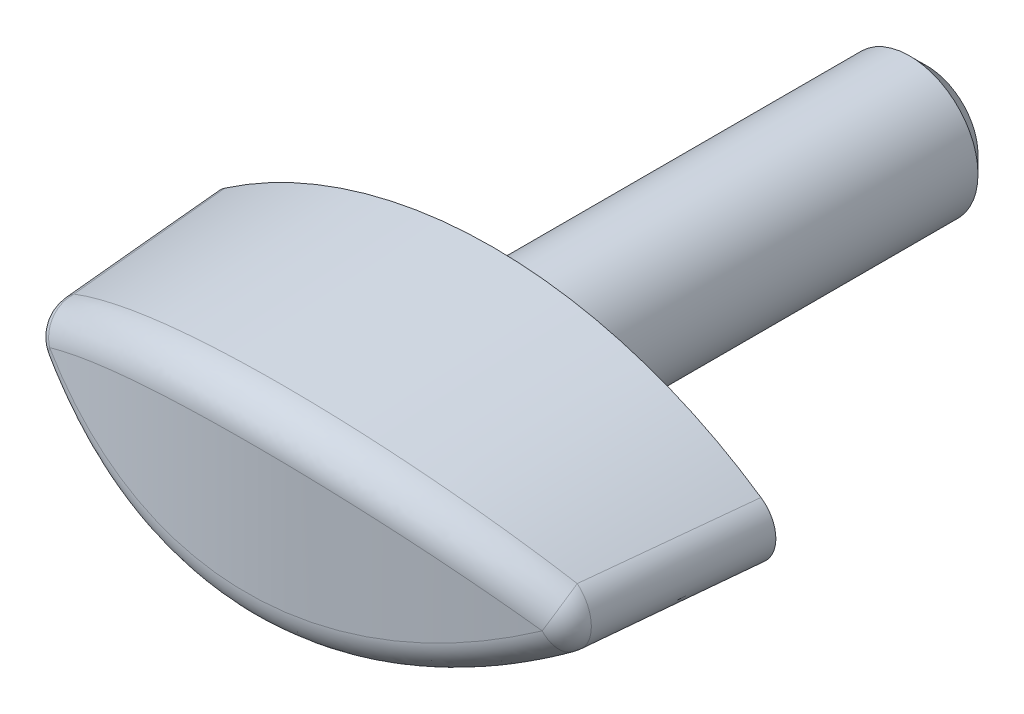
ISO-10303-21;
HEADER;
FILE_DESCRIPTION(('STEP AP214'),'2;1');
FILE_NAME('part.step','',(''),(''),'','','');
FILE_SCHEMA(('AUTOMOTIVE_DESIGN { 1 0 10303 214 1 1 1 1 }'));
ENDSEC;
DATA;
#1=APPLICATION_CONTEXT('core data for automotive mechanical design processes');
#2=APPLICATION_PROTOCOL_DEFINITION('international standard','automotive_design',2000,#1);
#3=PRODUCT_CONTEXT('',#1,'mechanical');
#4=PRODUCT('Part','Part','',(#3));
#5=PRODUCT_RELATED_PRODUCT_CATEGORY('part','',(#4));
#6=PRODUCT_DEFINITION_FORMATION('','',#4);
#7=PRODUCT_DEFINITION_CONTEXT('part definition',#1,'design');
#8=PRODUCT_DEFINITION('design','',#6,#7);
#9=PRODUCT_DEFINITION_SHAPE('','',#8);
#10=(LENGTH_UNIT() NAMED_UNIT(*) SI_UNIT(.MILLI.,.METRE.));
#11=(NAMED_UNIT(*) PLANE_ANGLE_UNIT() SI_UNIT($,.RADIAN.));
#12=(NAMED_UNIT(*) SI_UNIT($,.STERADIAN.) SOLID_ANGLE_UNIT());
#13=UNCERTAINTY_MEASURE_WITH_UNIT(LENGTH_MEASURE(1.E-05),#10,'distance_accuracy_value','');
#14=(GEOMETRIC_REPRESENTATION_CONTEXT(3) GLOBAL_UNCERTAINTY_ASSIGNED_CONTEXT((#13)) GLOBAL_UNIT_ASSIGNED_CONTEXT((#10,
#11,#12)) REPRESENTATION_CONTEXT('',''));
#15=CARTESIAN_POINT('',(0.,0.,0.));
#16=DIRECTION('',(0.,0.,1.));
#17=DIRECTION('',(1.,0.,0.));
#18=AXIS2_PLACEMENT_3D('',#15,#16,#17);
#19=CARTESIAN_POINT('',(-0.00046056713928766,-21.3,0.402832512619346));
#20=DIRECTION('',(0.,0.,-1.));
#21=DIRECTION('',(1.,0.,0.));
#22=AXIS2_PLACEMENT_3D('',#19,#20,#21);
#23=CONICAL_SURFACE('',#22,27.8,0.05235987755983);
#24=CARTESIAN_POINT('',(-0.00046056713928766,-21.3,0.402832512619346));
#25=DIRECTION('',(0.,0.,1.));
#26=DIRECTION('',(1.,0.,0.));
#27=AXIS2_PLACEMENT_3D('',#24,#25,#26);
#28=CIRCLE('',#27,27.8);
#29=CARTESIAN_POINT('',(15.6901745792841,1.6487247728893,0.402832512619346));
#30=VERTEX_POINT('',#29);
#31=CARTESIAN_POINT('',(-15.6910957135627,1.6487247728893,0.402832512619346));
#32=VERTEX_POINT('',#31);
#33=EDGE_CURVE('E235',#30,#32,#28,.T.);
#34=ORIENTED_EDGE('',*,*,#33,.T.);
#35=CARTESIAN_POINT('',(-14.153359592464,1.70103457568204,15.5433258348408));
#36=CARTESIAN_POINT('',(-15.0967597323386,1.11474020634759,15.6376699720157));
#37=CARTESIAN_POINT('',(-15.0967597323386,0.,15.6376699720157));
#38=CARTESIAN_POINT('',(-15.0967597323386,-1.11474020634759,15.6376699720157));
#39=CARTESIAN_POINT('',(-14.153359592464,-1.70103457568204,15.5433258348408));
#40=CARTESIAN_POINT('',(-14.3318556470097,1.69502029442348,13.8560872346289));
#41=CARTESIAN_POINT('',(-15.2654012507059,1.10725885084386,13.9512591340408));
#42=CARTESIAN_POINT('',(-15.2656662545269,0.,13.9485921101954));
#43=CARTESIAN_POINT('',(-15.2654012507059,-1.10725885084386,13.9512591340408));
#44=CARTESIAN_POINT('',(-14.3318556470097,-1.69502029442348,13.8560872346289));
#45=CARTESIAN_POINT('',(-14.5077422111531,1.68906895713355,12.1686183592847));
#46=CARTESIAN_POINT('',(-15.4319944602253,1.09998107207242,12.2619062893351));
#47=CARTESIAN_POINT('',(-15.4322394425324,0.,12.2593876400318));
#48=CARTESIAN_POINT('',(-15.4319944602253,-1.09998107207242,12.2619062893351));
#49=CARTESIAN_POINT('',(-14.5077422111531,-1.68906895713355,12.1686183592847));
#50=CARTESIAN_POINT('',(-14.8547932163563,1.67728860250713,8.79328893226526));
#51=CARTESIAN_POINT('',(-15.7609233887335,1.08581921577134,8.88327985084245));
#52=CARTESIAN_POINT('',(-15.7611684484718,0.,8.8807649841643));
#53=CARTESIAN_POINT('',(-15.7609233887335,-1.08581921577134,8.88327985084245));
#54=CARTESIAN_POINT('',(-14.8547932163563,-1.67728860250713,8.79328893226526));
#55=CARTESIAN_POINT('',(-15.0259577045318,1.6714595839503,7.10542838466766));
#56=CARTESIAN_POINT('',(-15.9233017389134,1.07893267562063,7.19369848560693));
#57=CARTESIAN_POINT('',(-15.9235243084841,0.,7.19134680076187));
#58=CARTESIAN_POINT('',(-15.9233017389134,-1.07893267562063,7.19369848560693));
#59=CARTESIAN_POINT('',(-15.0259577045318,-1.6714595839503,7.10542838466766));
#60=CARTESIAN_POINT('',(-15.6389500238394,1.6505385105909,0.984561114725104));
#61=CARTESIAN_POINT('',(-16.5038593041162,1.0546564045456,1.08135142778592));
#62=CARTESIAN_POINT('',(-16.5054048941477,0.,1.0651008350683));
#63=CARTESIAN_POINT('',(-16.5038593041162,-1.0546564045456,1.08135142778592));
#64=CARTESIAN_POINT('',(-15.6389500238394,-1.6505385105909,0.984561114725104));
#65=CARTESIAN_POINT('',(-16.0683322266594,1.63579618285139,-3.44949652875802));
#66=CARTESIAN_POINT('',(-16.9125731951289,1.03822558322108,-3.35834908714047));
#67=CARTESIAN_POINT('',(-16.9138312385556,0.,-3.37233993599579));
#68=CARTESIAN_POINT('',(-16.9125731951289,-1.03822558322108,-3.35834908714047));
#69=CARTESIAN_POINT('',(-16.0683322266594,-1.63579618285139,-3.44949652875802));
#70=CARTESIAN_POINT('',(-16.9043767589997,1.60706856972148,-12.3194329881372));
#71=CARTESIAN_POINT('',(-17.7092403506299,1.00727593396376,-12.2345017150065));
#72=CARTESIAN_POINT('',(-17.7104809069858,0.,-12.2483492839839));
#73=CARTESIAN_POINT('',(-17.7092403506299,-1.00727593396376,-12.2345017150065));
#74=CARTESIAN_POINT('',(-16.9043767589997,-1.60706856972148,-12.3194329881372));
#75=CARTESIAN_POINT('',(-17.3110389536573,1.59308328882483,-16.7553118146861));
#76=CARTESIAN_POINT('',(-18.0976673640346,0.99273181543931,-16.6748115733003));
#77=CARTESIAN_POINT('',(-18.0987041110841,0.,-16.6869178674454));
#78=CARTESIAN_POINT('',(-18.0976673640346,-0.99273181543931,-16.6748115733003));
#79=CARTESIAN_POINT('',(-17.3110389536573,-1.59308328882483,-16.7553118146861));
#80=CARTESIAN_POINT('',(-18.1060525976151,1.56581345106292,-25.6287021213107));
#81=CARTESIAN_POINT('',(-18.8578714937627,0.965180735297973,-25.5531499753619));
#82=CARTESIAN_POINT('',(-18.8589022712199,0.,-25.5651900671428));
#83=CARTESIAN_POINT('',(-18.8578714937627,-0.965180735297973,-25.5531499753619));
#84=CARTESIAN_POINT('',(-18.1060525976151,-1.56581345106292,-25.6287021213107));
#85=CARTESIAN_POINT('',(-18.4944030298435,1.55252893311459,-30.0662136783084));
#86=CARTESIAN_POINT('',(-19.2300008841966,0.952156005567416,-29.9942634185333));
#87=CARTESIAN_POINT('',(-19.2308763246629,0.,-30.0048937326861));
#88=CARTESIAN_POINT('',(-19.2300008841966,-0.952156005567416,-29.9942634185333));
#89=CARTESIAN_POINT('',(-18.4944030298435,-1.55252893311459,-30.0662136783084));
#90=CARTESIAN_POINT('',(-19.0655893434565,1.53309045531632,-36.7232735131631));
#91=CARTESIAN_POINT('',(-19.7785728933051,0.933545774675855,-36.6623287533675));
#92=CARTESIAN_POINT('',(-19.778789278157,0.,-36.6649644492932));
#93=CARTESIAN_POINT('',(-19.7785728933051,-0.933545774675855,-36.6623287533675));
#94=CARTESIAN_POINT('',(-19.0655893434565,-1.53309045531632,-36.7232735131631));
#95=CARTESIAN_POINT('',(-19.2540937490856,1.52669238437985,-38.9424116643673));
#96=CARTESIAN_POINT('',(-19.959549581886,0.927505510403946,-38.8825669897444));
#97=CARTESIAN_POINT('',(-19.9597511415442,0.,-38.885060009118));
#98=CARTESIAN_POINT('',(-19.959549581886,-0.927505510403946,-38.8825669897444));
#99=CARTESIAN_POINT('',(-19.2540937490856,-1.52669238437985,-38.9424116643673));
#100=CARTESIAN_POINT('',(-19.6276330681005,1.51405317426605,-43.3809342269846));
#101=CARTESIAN_POINT('',(-20.3184015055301,0.915713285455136,-43.3229335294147));
#102=CARTESIAN_POINT('',(-20.3186020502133,0.,-43.3254160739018));
#103=CARTESIAN_POINT('',(-20.3184015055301,-0.915713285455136,-43.3229335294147));
#104=CARTESIAN_POINT('',(-19.6276330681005,-1.51405317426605,-43.3809342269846));
#105=CARTESIAN_POINT('',(-19.8126679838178,1.50781203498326,-45.6003186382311));
#106=CARTESIAN_POINT('',(-20.4963068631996,0.909959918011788,-45.5433489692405));
#107=CARTESIAN_POINT('',(-20.4964910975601,0.,-45.5456765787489));
#108=CARTESIAN_POINT('',(-20.4963068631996,-0.909959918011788,-45.5433489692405));
#109=CARTESIAN_POINT('',(-19.8126679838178,-1.50781203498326,-45.6003186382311));
#110=CARTESIAN_POINT('',(-19.9961229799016,1.50164645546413,-47.8198140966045));
#111=CARTESIAN_POINT('',(-20.6729817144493,0.904332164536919,-47.7660130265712));
#112=CARTESIAN_POINT('',(-20.6729817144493,0.,-47.7660130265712));
#113=CARTESIAN_POINT('',(-20.6729817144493,-0.904332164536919,-47.7660130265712));
#114=CARTESIAN_POINT('',(-19.9961229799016,-1.50164645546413,-47.8198140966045));
#115=(BOUNDED_SURFACE() B_SPLINE_SURFACE(3,2,((#35,#36,#37,#38,#39),(#40,#41,#42,#43,#44),(#45,
#46,#47,#48,#49),(#50,#51,#52,#53,#54),(#55,#56,#57,#58,#59),(#60,#61,#62,#63,#64),(#65,#66,#67,
#68,#69),(#70,#71,#72,#73,#74),(#75,#76,#77,#78,#79),(#80,#81,#82,#83,#84),(#85,#86,#87,#88,
#89),(#90,#91,#92,#93,#94),(#95,#96,#97,#98,#99),(#100,#101,#102,#103,#104),(#105,#106,#107,
#108,#109),(#110,#111,#112,#113,#114)),.UNSPECIFIED.,.F.,.F.,
.F.) B_SPLINE_SURFACE_WITH_KNOTS((4,2,2,2,2,2,2,4),(3,2,3),(0.,5.08695661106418,
10.1738624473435,23.5321935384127,36.8906039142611,50.2497553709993,56.9292475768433,
63.6087352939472),(0.,0.5,1.),
.UNSPECIFIED.) GEOMETRIC_REPRESENTATION_ITEM() RATIONAL_B_SPLINE_SURFACE(((1.,0.873483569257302,
1.,0.873483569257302,1.),(1.,0.874875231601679,1.,0.874875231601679,1.),(1.,0.876222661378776,
1.,0.876222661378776,1.),(1.,0.878837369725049,1.,0.878837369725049,1.),(1.,0.880104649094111,
1.,0.880104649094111,1.),(1.,0.884569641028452,1.,0.884569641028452,1.),(1.,0.887555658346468,
1.,0.887555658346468,1.),(1.,0.893140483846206,1.,0.893140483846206,1.),(1.,0.895739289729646,
1.,0.895739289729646,1.),(1.,0.90062485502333,1.,0.90062485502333,1.),(1.,0.902911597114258,1.,
0.902911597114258,1.),(1.,0.906149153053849,1.,0.906149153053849,1.),(1.,0.907196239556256,1.,
0.907196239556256,1.),(1.,0.909231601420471,1.,0.909231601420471,1.),(1.,0.910219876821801,1.,
0.910219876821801,1.),(1.,0.911181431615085,1.,0.911181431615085,1.))) REPRESENTATION_ITEM('') SURFACE());
#116=CARTESIAN_POINT('',(-19.9961229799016,1.50164645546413,-47.8198140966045));
#117=CARTESIAN_POINT('',(-19.8126679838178,1.50781203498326,-45.6003186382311));
#118=CARTESIAN_POINT('',(-19.6276330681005,1.51405317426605,-43.3809342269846));
#119=CARTESIAN_POINT('',(-19.2540937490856,1.52669238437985,-38.9424116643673));
#120=CARTESIAN_POINT('',(-19.0655893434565,1.53309045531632,-36.7232735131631));
#121=CARTESIAN_POINT('',(-18.4944030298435,1.55252893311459,-30.0662136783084));
#122=CARTESIAN_POINT('',(-18.1060525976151,1.56581345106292,-25.6287021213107));
#123=CARTESIAN_POINT('',(-17.3110389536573,1.59308328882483,-16.7553118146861));
#124=CARTESIAN_POINT('',(-16.9043767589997,1.60706856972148,-12.3194329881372));
#125=CARTESIAN_POINT('',(-16.0683322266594,1.63579618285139,-3.44949652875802));
#126=CARTESIAN_POINT('',(-15.6389500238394,1.6505385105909,0.984561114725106));
#127=CARTESIAN_POINT('',(-15.0259577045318,1.6714595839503,7.10542838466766));
#128=CARTESIAN_POINT('',(-14.8547932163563,1.67728860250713,8.79328893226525));
#129=CARTESIAN_POINT('',(-14.5077422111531,1.68906895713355,12.1686183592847));
#130=CARTESIAN_POINT('',(-14.3318556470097,1.69502029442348,13.8560872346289));
#131=CARTESIAN_POINT('',(-14.153359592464,1.70103457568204,15.5433258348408));
#132=B_SPLINE_CURVE_WITH_KNOTS('',3,(#116,#117,#118,#119,#120,#121,#122,#123,#124,#125,#126,
#127,#128,#129,#130,#131),.UNSPECIFIED.,.F.,.F.,(4,2,2,2,2,2,2,4),(0.,6.67948771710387,
13.3589799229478,26.7181313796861,40.0765417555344,53.4348728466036,58.521778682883,
63.6087352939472),.UNSPECIFIED.);
#133=CARTESIAN_POINT('',(-14.7065623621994,1.6823200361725,10.2347792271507));
#134=VERTEX_POINT('',#133);
#135=EDGE_CURVE('E185',#32,#134,#132,.T.);
#136=ORIENTED_EDGE('',*,*,#135,.T.);
#137=CARTESIAN_POINT('',(-20.0811536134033,-4.41765469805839,9.06202354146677));
#138=CARTESIAN_POINT('',(-20.794375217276,-3.4970775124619,8.6163077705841));
#139=CARTESIAN_POINT('',(-20.5149823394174,-3.09184561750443,7.47064783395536));
#140=CARTESIAN_POINT('',(-19.815137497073,-4.14625680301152,9.22826762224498));
#141=CARTESIAN_POINT('',(-20.5308171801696,-3.20305312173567,8.78928580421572));
#142=CARTESIAN_POINT('',(-20.2437516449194,-2.79870414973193,7.62808936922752));
#143=CARTESIAN_POINT('',(-19.5427558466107,-3.88016952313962,9.39387699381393));
#144=CARTESIAN_POINT('',(-20.2613659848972,-2.91519162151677,8.96138644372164));
#145=CARTESIAN_POINT('',(-19.9659982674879,-2.51127069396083,7.78492980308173));
#146=CARTESIAN_POINT('',(-18.9853591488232,-3.35883373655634,9.72289567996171));
#147=CARTESIAN_POINT('',(-19.7089688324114,-2.34984852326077,9.30413773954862));
#148=CARTESIAN_POINT('',(-19.3975413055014,-1.94806022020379,8.09652710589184));
#149=CARTESIAN_POINT('',(-18.700343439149,-3.10358579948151,9.88630487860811));
#150=CARTESIAN_POINT('',(-19.4258932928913,-2.07241226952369,9.47479653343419));
#151=CARTESIAN_POINT('',(-19.1068370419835,-1.67228381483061,8.25128386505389));
#152=CARTESIAN_POINT('',(-17.8259485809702,-2.35396683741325,10.3721355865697));
#153=CARTESIAN_POINT('',(-18.5525101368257,-1.25251492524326,9.98539122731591));
#154=CARTESIAN_POINT('',(-18.214886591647,-0.86230322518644,8.71139006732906));
#155=CARTESIAN_POINT('',(-17.2177574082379,-1.8762677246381,10.689821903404));
#156=CARTESIAN_POINT('',(-17.9443331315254,-0.729523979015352,10.3197588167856));
#157=CARTESIAN_POINT('',(-17.5943489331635,-0.346038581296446,9.01225504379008));
#158=CARTESIAN_POINT('',(-15.9491742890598,-0.965762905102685,11.3068819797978));
#159=CARTESIAN_POINT('',(-16.6701568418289,0.273374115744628,10.9732009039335));
#160=CARTESIAN_POINT('',(-16.2997263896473,0.638135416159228,9.59664208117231));
#161=CARTESIAN_POINT('',(-15.2884707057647,-0.533266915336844,11.6061242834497));
#162=CARTESIAN_POINT('',(-16.0031357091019,0.752117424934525,11.2918009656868));
#163=CARTESIAN_POINT('',(-15.6253216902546,1.1057110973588,9.88003964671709));
#164=CARTESIAN_POINT('',(-13.9208675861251,0.279150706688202,12.1765559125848));
#165=CARTESIAN_POINT('',(-14.6152521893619,1.65761638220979,11.9033901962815));
#166=CARTESIAN_POINT('',(-14.2290764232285,1.98415563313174,10.4202671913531));
#167=CARTESIAN_POINT('',(-13.2139942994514,0.659101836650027,12.4477609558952));
#168=CARTESIAN_POINT('',(-13.8940627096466,2.08328537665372,12.1957872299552));
#169=CARTESIAN_POINT('',(-13.5072628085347,2.3950563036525,10.6771120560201));
#170=CARTESIAN_POINT('',(-11.9037976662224,1.29127459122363,12.9040328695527));
#171=CARTESIAN_POINT('',(-12.5513754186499,2.79582931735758,12.6907809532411));
#172=CARTESIAN_POINT('',(-12.169137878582,3.07881265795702,11.1092245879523));
#173=CARTESIAN_POINT('',(-11.3082180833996,1.55381959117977,13.0954566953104));
#174=CARTESIAN_POINT('',(-11.937530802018,3.09343963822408,12.8996952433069));
#175=CARTESIAN_POINT('',(-11.5607814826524,3.36281474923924,11.2905126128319));
#176=CARTESIAN_POINT('',(-10.0920972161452,2.03992330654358,13.4523500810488));
#177=CARTESIAN_POINT('',(-10.6779261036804,3.64779713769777,13.2916186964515));
#178=CARTESIAN_POINT('',(-10.3184198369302,3.88869405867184,11.6285086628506));
#179=CARTESIAN_POINT('',(-9.47156072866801,2.26348947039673,13.61782459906));
#180=CARTESIAN_POINT('',(-10.0325856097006,3.90376958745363,13.4741122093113));
#181=CARTESIAN_POINT('',(-9.68441951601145,4.13057932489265,11.7852213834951));
#182=CARTESIAN_POINT('',(-8.21085725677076,2.66837293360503,13.9189969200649));
#183=CARTESIAN_POINT('',(-8.71506821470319,4.37008842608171,13.8082918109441));
#184=CARTESIAN_POINT('',(-8.39623064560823,4.56867140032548,12.0704467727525));
#185=CARTESIAN_POINT('',(-7.57076855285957,2.84983870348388,14.0547992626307));
#186=CARTESIAN_POINT('',(-8.04373214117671,4.57980517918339,13.9595380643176));
#187=CARTESIAN_POINT('',(-7.74212254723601,4.76503873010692,12.1990584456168));
#188=CARTESIAN_POINT('',(-6.27276490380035,3.16913872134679,14.294446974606));
#189=CARTESIAN_POINT('',(-6.67611405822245,4.95084987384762,14.2279730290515));
#190=CARTESIAN_POINT('',(-6.41558263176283,5.1105777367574,12.42601692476));
#191=CARTESIAN_POINT('',(-5.6148541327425,3.30698309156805,14.3982997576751));
#192=CARTESIAN_POINT('',(-5.98095824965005,5.11144433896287,14.3446384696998));
#193=CARTESIAN_POINT('',(-5.74315510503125,5.25976036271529,12.524370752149));
#194=CARTESIAN_POINT('',(-4.469550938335,3.50526400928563,14.5477369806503));
#195=CARTESIAN_POINT('',(-4.76699841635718,5.34334265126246,14.513216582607));
#196=CARTESIAN_POINT('',(-4.57251302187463,5.47435769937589,12.6658953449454));
#197=CARTESIAN_POINT('',(-3.98527879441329,3.57656511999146,14.6014927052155));
#198=CARTESIAN_POINT('',(-4.25248577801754,5.42691580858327,14.5740114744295));
#199=CARTESIAN_POINT('',(-4.07750634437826,5.55152868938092,12.7168047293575));
#200=CARTESIAN_POINT('',(-3.01174289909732,3.69472517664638,14.6903879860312));
#201=CARTESIAN_POINT('',(-3.21589634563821,5.56575349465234,14.6748365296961));
#202=CARTESIAN_POINT('',(-3.08236136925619,5.67941760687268,12.8009930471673));
#203=CARTESIAN_POINT('',(-2.52247966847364,3.74158664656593,14.7255294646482));
#204=CARTESIAN_POINT('',(-2.69445046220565,5.62084543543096,14.7147407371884));
#205=CARTESIAN_POINT('',(-2.58222360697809,5.7301382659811,12.8342738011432));
#206=CARTESIAN_POINT('',(-1.54056281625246,3.81050009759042,14.7767608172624));
#207=CARTESIAN_POINT('',(-1.64628256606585,5.70198847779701,14.7730659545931));
#208=CARTESIAN_POINT('',(-1.57846523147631,5.80472574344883,12.8827924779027));
#209=CARTESIAN_POINT('',(-1.04790652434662,3.83252956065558,14.7928333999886));
#210=CARTESIAN_POINT('',(-1.12024397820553,5.72790625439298,14.7913894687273));
#211=CARTESIAN_POINT('',(-1.07484187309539,5.82856818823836,12.8980140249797));
#212=CARTESIAN_POINT('',(-0.0619125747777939,3.85152073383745,14.805659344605));
#213=CARTESIAN_POINT('',(-0.0664657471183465,5.75020151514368,14.8061034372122));
#214=CARTESIAN_POINT('',(-0.0668941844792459,5.84911822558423,12.9101608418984));
#215=CARTESIAN_POINT('',(0.431424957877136,3.84848655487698,14.8024158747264));
#216=CARTESIAN_POINT('',(0.460560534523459,5.74655453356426,14.8024769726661));
#217=CARTESIAN_POINT('',(0.437430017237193,5.84583026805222,12.9070891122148));
#218=CARTESIAN_POINT('',(1.60255721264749,3.81150451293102,14.7717686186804));
#219=CARTESIAN_POINT('',(1.71175123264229,5.70275305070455,14.7677795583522));
#220=CARTESIAN_POINT('',(1.63463358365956,5.80579033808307,12.8780646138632));
#221=CARTESIAN_POINT('',(2.27978109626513,3.76633440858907,14.7357181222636));
#222=CARTESIAN_POINT('',(2.43402260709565,5.64946733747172,14.7269642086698));
#223=CARTESIAN_POINT('',(2.32692566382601,5.75689079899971,12.8439229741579));
#224=CARTESIAN_POINT('',(3.62612133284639,3.6292355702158,14.6278577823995));
#225=CARTESIAN_POINT('',(3.86899032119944,5.48787530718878,14.6048083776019));
#226=CARTESIAN_POINT('',(3.70317371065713,5.60848345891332,12.7417737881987));
#227=CARTESIAN_POINT('',(4.295235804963,3.53729619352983,14.5560397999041));
#228=CARTESIAN_POINT('',(4.57997445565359,5.37995560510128,14.5237564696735));
#229=CARTESIAN_POINT('',(4.38712774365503,5.50896413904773,12.6737585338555));
#230=CARTESIAN_POINT('',(5.620453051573,3.30807293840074,14.3782886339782));
#231=CARTESIAN_POINT('',(5.98551056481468,5.11135398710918,14.323447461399));
#232=CARTESIAN_POINT('',(5.74165729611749,5.26085961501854,12.5054192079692));
#233=CARTESIAN_POINT('',(6.27654930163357,3.17076690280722,14.2723387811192));
#234=CARTESIAN_POINT('',(6.67861072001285,4.95125521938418,14.2046189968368));
#235=CARTESIAN_POINT('',(6.41222610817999,5.11225043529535,12.4050793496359));
#236=CARTESIAN_POINT('',(7.57081563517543,2.85284943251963,14.0287113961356));
#237=CARTESIAN_POINT('',(8.04198725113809,4.58157504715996,13.9321193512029));
#238=CARTESIAN_POINT('',(7.73493729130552,4.76818970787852,12.1743519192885));
#239=CARTESIAN_POINT('',(8.20898646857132,2.67223981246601,13.8910351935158));
#240=CARTESIAN_POINT('',(8.71115884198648,4.37273579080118,13.7789822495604));
#241=CARTESIAN_POINT('',(8.38708043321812,4.57274012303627,12.0439656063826));
#242=CARTESIAN_POINT('',(9.45972662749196,2.27134461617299,13.5877932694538));
#243=CARTESIAN_POINT('',(10.018010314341,3.91078956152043,13.4428892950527));
#244=CARTESIAN_POINT('',(9.66507796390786,4.13894650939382,11.7567801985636));
#245=CARTESIAN_POINT('',(10.0724307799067,2.05131346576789,13.4224068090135));
#246=CARTESIAN_POINT('',(10.6550893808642,3.6587567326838,13.2606777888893));
#247=CARTESIAN_POINT('',(10.2910709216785,3.90087755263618,11.600150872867));
#248=CARTESIAN_POINT('',(11.2734423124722,1.57331508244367,13.0663341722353));
#249=CARTESIAN_POINT('',(11.8988735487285,3.11342074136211,12.870007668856));
#250=CARTESIAN_POINT('',(11.5179880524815,3.38374983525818,11.2629321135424));
#251=CARTESIAN_POINT('',(11.861749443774,1.31534746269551,12.8756477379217));
#252=CARTESIAN_POINT('',(12.5051806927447,2.82087015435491,12.6620530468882));
#253=CARTESIAN_POINT('',(12.1189119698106,3.10469065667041,11.0823424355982));
#254=CARTESIAN_POINT('',(13.0124178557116,0.763585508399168,12.4721015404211));
#255=CARTESIAN_POINT('',(13.6860353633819,2.19779571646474,12.2239210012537));
#256=CARTESIAN_POINT('',(13.2941017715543,2.50788863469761,10.7001638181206));
#257=CARTESIAN_POINT('',(13.5747438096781,0.469744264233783,12.259212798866));
#258=CARTESIAN_POINT('',(14.2604369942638,1.86790212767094,11.9941414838));
#259=CARTESIAN_POINT('',(13.8683313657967,2.19009514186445,10.4985474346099));
#260=CARTESIAN_POINT('',(14.6709415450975,-0.151187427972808,11.8149774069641));
#261=CARTESIAN_POINT('',(15.3754021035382,1.17378101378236,11.5168362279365));
#262=CARTESIAN_POINT('',(14.9875696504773,1.51863734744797,10.0778340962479));
#263=CARTESIAN_POINT('',(15.2048097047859,-0.478282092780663,11.5836284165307));
#264=CARTESIAN_POINT('',(15.9160811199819,0.810131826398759,11.2696393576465));
#265=CARTESIAN_POINT('',(15.5325746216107,1.16496849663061,9.85873492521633));
#266=CARTESIAN_POINT('',(16.3010347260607,-1.2020925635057,11.0792697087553));
#267=CARTESIAN_POINT('',(17.0209453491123,0.00934023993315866,10.7334934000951));
#268=CARTESIAN_POINT('',(16.6514893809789,0.382463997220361,9.38108177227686));
#269=CARTESIAN_POINT('',(16.859863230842,-1.60250195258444,10.8044985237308));
#270=CARTESIAN_POINT('',(17.5821760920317,-0.431467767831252,10.4428567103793));
#271=CARTESIAN_POINT('',(17.2217772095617,-0.0503529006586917,9.12085959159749));
#272=CARTESIAN_POINT('',(17.93940530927,-2.43944703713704,10.241618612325));
#273=CARTESIAN_POINT('',(18.6616083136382,-1.34884391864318,9.85027402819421));
#274=CARTESIAN_POINT('',(18.3232481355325,-0.954885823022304,8.5877839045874));
#275=CARTESIAN_POINT('',(18.4601120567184,-2.87598917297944,9.95350751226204));
#276=CARTESIAN_POINT('',(19.1803900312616,-1.82496232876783,9.54846485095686));
#277=CARTESIAN_POINT('',(18.8544242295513,-1.42660878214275,8.31492815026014));
#278=CARTESIAN_POINT('',(19.4601451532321,-3.78132024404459,9.37044845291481));
#279=CARTESIAN_POINT('',(20.172691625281,-2.80841975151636,8.94035828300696));
#280=CARTESIAN_POINT('',(19.8743614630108,-2.40473038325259,7.76274179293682));
#281=CARTESIAN_POINT('',(19.9396415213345,-4.2499607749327,9.07553565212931));
#282=CARTESIAN_POINT('',(20.647062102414,-3.31530887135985,8.63408727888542));
#283=CARTESIAN_POINT('',(20.3632969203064,-2.91096939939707,7.48344448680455));
#284=CARTESIAN_POINT('',(20.6287720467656,-4.97711707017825,8.63137956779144));
#285=CARTESIAN_POINT('',(21.3283507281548,-4.10131871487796,8.173304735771));
#286=CARTESIAN_POINT('',(21.0658500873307,-3.69632587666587,7.06280625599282));
#287=CARTESIAN_POINT('',(20.8534327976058,-5.22349757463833,8.4830513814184));
#288=CARTESIAN_POINT('',(21.5494719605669,-4.36633664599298,8.02017946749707));
#289=CARTESIAN_POINT('',(21.2948618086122,-3.96240386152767,6.92233197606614));
#290=CARTESIAN_POINT('',(21.2926427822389,-5.72427052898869,8.18649529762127));
#291=CARTESIAN_POINT('',(21.9810585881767,-4.904043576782,7.71461878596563));
#292=CARTESIAN_POINT('',(21.7425310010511,-4.50316520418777,6.6414783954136));
#293=CARTESIAN_POINT('',(21.507191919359,-5.97866305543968,8.03826740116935));
#294=CARTESIAN_POINT('',(22.1916197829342,-5.17672868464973,7.56215587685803));
#295=CARTESIAN_POINT('',(21.9611883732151,-4.77784864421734,6.50109909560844));
#296=CARTESIAN_POINT('',(21.7166323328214,-6.23702325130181,7.89044601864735));
#297=CARTESIAN_POINT('',(22.3974453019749,-5.45401421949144,7.40994062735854));
#298=CARTESIAN_POINT('',(22.1746166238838,-5.05679182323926,6.36110478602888));
#299=(BOUNDED_SURFACE() B_SPLINE_SURFACE(3,2,((#137,#138,#139),(#140,#141,#142),(#143,#144,
#145),(#146,#147,#148),(#149,#150,#151),(#152,#153,#154),(#155,#156,#157),(#158,#159,#160),
(#161,#162,#163),(#164,#165,#166),(#167,#168,#169),(#170,#171,#172),(#173,#174,#175),(#176,#177,
#178),(#179,#180,#181),(#182,#183,#184),(#185,#186,#187),(#188,#189,#190),(#191,#192,#193),
(#194,#195,#196),(#197,#198,#199),(#200,#201,#202),(#203,#204,#205),(#206,#207,#208),(#209,#210,
#211),(#212,#213,#214),(#215,#216,#217),(#218,#219,#220),(#221,#222,#223),(#224,#225,#226),
(#227,#228,#229),(#230,#231,#232),(#233,#234,#235),(#236,#237,#238),(#239,#240,#241),(#242,#243,
#244),(#245,#246,#247),(#248,#249,#250),(#251,#252,#253),(#254,#255,#256),(#257,#258,#259),
(#260,#261,#262),(#263,#264,#265),(#266,#267,#268),(#269,#270,#271),(#272,#273,#274),(#275,#276,
#277),(#278,#279,#280),(#281,#282,#283),(#284,#285,#286),(#287,#288,#289),(#290,#291,#292),
(#293,#294,#295),(#296,#297,#298)),.UNSPECIFIED.,.F.,.F.,.F.) B_SPLINE_SURFACE_WITH_KNOTS((4,2,
2,2,2,2,2,2,2,2,2,2,2,2,2,2,2,2,2,2,2,2,2,2,2,2,4),(3,3),(0.,1.20698527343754,2.41403389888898,
4.8305598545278,7.26268570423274,9.6934406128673,11.6356284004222,13.5774446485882,
15.5123051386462,17.4467163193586,18.8465647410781,20.2462685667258,21.6472406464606,
23.0479829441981,24.9767574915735,26.9059711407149,28.8361284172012,30.7662048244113,
32.6842460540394,34.6023068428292,36.522903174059,38.4437433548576,40.580186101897,
42.7170104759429,44.844547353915,45.9080071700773,46.9714771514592),(0.,1.),
.UNSPECIFIED.) GEOMETRIC_REPRESENTATION_ITEM() RATIONAL_B_SPLINE_SURFACE(((1.,0.848585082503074,
1.),(1.,0.845596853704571,1.),(1.,0.842576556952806,1.),(1.,0.836489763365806,1.),(1.,
0.833423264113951,1.),(1.,0.82417564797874,1.),(1.,0.817952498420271,1.),(1.,0.805532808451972,
1.),(1.,0.79933669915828,1.),(1.,0.787223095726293,1.),(1.,0.781305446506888,1.),(1.,
0.771122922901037,1.),(1.,0.766764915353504,1.),(1.,0.758508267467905,1.),(1.,0.754609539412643,
1.),(1.,0.747416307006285,1.),(1.,0.744119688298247,1.),(1.,0.738238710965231,1.),(1.,
0.735654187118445,1.),(1.,0.731904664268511,1.),(1.,0.730544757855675,1.),(1.,0.728284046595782,
1.),(1.,0.727383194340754,1.),(1.,0.72606162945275,1.),(1.,0.72564135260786,1.),(1.,
0.725292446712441,1.),(1.,0.725363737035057,1.),(1.,0.726116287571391,1.),(1.,0.727017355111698,
1.),(1.,0.729709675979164,1.),(1.,0.731501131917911,1.),(1.,0.735896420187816,1.),(1.,
0.738500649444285,1.),(1.,0.74441421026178,1.),(1.,0.747723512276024,1.),(1.,0.754900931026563,
1.),(1.,0.75876543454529,1.),(1.,0.766940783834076,1.),(1.,0.771251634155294,1.),(1.,
0.780199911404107,1.),(1.,0.784837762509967,1.),(1.,0.794317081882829,1.),(1.,0.799158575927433,
1.),(1.,0.809486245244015,1.),(1.,0.814983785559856,1.),(1.,0.825966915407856,1.),(1.,
0.831452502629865,1.),(1.,0.842274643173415,1.),(1.,0.847611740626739,1.),(1.,0.855448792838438,
1.),(1.,0.858032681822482,1.),(1.,0.863134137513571,1.),(1.,0.865651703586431,1.),(1.,
0.868130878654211,1.))) REPRESENTATION_ITEM('') SURFACE());
#300=CARTESIAN_POINT('',(-20.5149823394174,-3.09184561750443,7.47064783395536));
#301=CARTESIAN_POINT('',(-20.2437516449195,-2.79870414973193,7.62808936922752));
#302=CARTESIAN_POINT('',(-19.9659982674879,-2.51127069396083,7.78492980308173));
#303=CARTESIAN_POINT('',(-19.3975413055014,-1.94806022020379,8.09652710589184));
#304=CARTESIAN_POINT('',(-19.1068370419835,-1.67228381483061,8.25128386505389));
#305=CARTESIAN_POINT('',(-18.214886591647,-0.86230322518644,8.71139006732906));
#306=CARTESIAN_POINT('',(-17.5943489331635,-0.346038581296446,9.01225504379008));
#307=CARTESIAN_POINT('',(-16.2997263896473,0.638135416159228,9.59664208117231));
#308=CARTESIAN_POINT('',(-15.6253216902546,1.1057110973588,9.88003964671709));
#309=CARTESIAN_POINT('',(-14.2290764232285,1.98415563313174,10.4202671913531));
#310=CARTESIAN_POINT('',(-13.5072628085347,2.3950563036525,10.6771120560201));
#311=CARTESIAN_POINT('',(-12.169137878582,3.07881265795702,11.1092245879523));
#312=CARTESIAN_POINT('',(-11.5607814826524,3.36281474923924,11.2905126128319));
#313=CARTESIAN_POINT('',(-10.3184198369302,3.88869405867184,11.6285086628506));
#314=CARTESIAN_POINT('',(-9.68441951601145,4.13057932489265,11.7852213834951));
#315=CARTESIAN_POINT('',(-8.39623064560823,4.56867140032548,12.0704467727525));
#316=CARTESIAN_POINT('',(-7.74212254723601,4.76503873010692,12.1990584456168));
#317=CARTESIAN_POINT('',(-6.41558263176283,5.1105777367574,12.42601692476));
#318=CARTESIAN_POINT('',(-5.74315510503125,5.25976036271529,12.524370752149));
#319=CARTESIAN_POINT('',(-4.57251302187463,5.47435769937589,12.6658953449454));
#320=CARTESIAN_POINT('',(-4.07750634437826,5.55152868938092,12.7168047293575));
#321=CARTESIAN_POINT('',(-3.08236136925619,5.67941760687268,12.8009930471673));
#322=CARTESIAN_POINT('',(-2.58222360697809,5.7301382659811,12.8342738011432));
#323=CARTESIAN_POINT('',(-1.57846523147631,5.80472574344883,12.8827924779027));
#324=CARTESIAN_POINT('',(-1.07484187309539,5.82856818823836,12.8980140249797));
#325=CARTESIAN_POINT('',(-0.0668941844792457,5.84911822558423,12.9101608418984));
#326=CARTESIAN_POINT('',(0.437430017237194,5.84583026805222,12.9070891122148));
#327=CARTESIAN_POINT('',(1.63463358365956,5.80579033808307,12.8780646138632));
#328=CARTESIAN_POINT('',(2.326925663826,5.75689079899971,12.8439229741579));
#329=CARTESIAN_POINT('',(3.70317371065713,5.60848345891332,12.7417737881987));
#330=CARTESIAN_POINT('',(4.38712774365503,5.50896413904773,12.6737585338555));
#331=CARTESIAN_POINT('',(5.74165729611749,5.26085961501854,12.5054192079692));
#332=CARTESIAN_POINT('',(6.41222610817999,5.11225043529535,12.4050793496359));
#333=CARTESIAN_POINT('',(7.73493729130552,4.76818970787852,12.1743519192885));
#334=CARTESIAN_POINT('',(8.38708043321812,4.57274012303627,12.0439656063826));
#335=CARTESIAN_POINT('',(9.66507796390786,4.13894650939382,11.7567801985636));
#336=CARTESIAN_POINT('',(10.2910709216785,3.90087755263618,11.600150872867));
#337=CARTESIAN_POINT('',(11.5179880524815,3.38374983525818,11.2629321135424));
#338=CARTESIAN_POINT('',(12.1189119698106,3.10469065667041,11.0823424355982));
#339=CARTESIAN_POINT('',(13.2941017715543,2.50788863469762,10.7001638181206));
#340=CARTESIAN_POINT('',(13.8683313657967,2.19009514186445,10.4985474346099));
#341=CARTESIAN_POINT('',(14.9875696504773,1.51863734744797,10.0778340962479));
#342=CARTESIAN_POINT('',(15.5325746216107,1.16496849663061,9.85873492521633));
#343=CARTESIAN_POINT('',(16.6514893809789,0.382463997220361,9.38108177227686));
#344=CARTESIAN_POINT('',(17.2217772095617,-0.0503529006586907,9.12085959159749));
#345=CARTESIAN_POINT('',(18.3232481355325,-0.954885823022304,8.5877839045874));
#346=CARTESIAN_POINT('',(18.8544242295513,-1.42660878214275,8.31492815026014));
#347=CARTESIAN_POINT('',(19.8743614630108,-2.40473038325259,7.76274179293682));
#348=CARTESIAN_POINT('',(20.3632969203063,-2.91096939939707,7.48344448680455));
#349=CARTESIAN_POINT('',(21.0658500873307,-3.69632587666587,7.06280625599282));
#350=CARTESIAN_POINT('',(21.2948618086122,-3.96240386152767,6.92233197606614));
#351=CARTESIAN_POINT('',(21.7425310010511,-4.50316520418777,6.6414783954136));
#352=CARTESIAN_POINT('',(21.9611883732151,-4.77784864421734,6.50109909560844));
#353=CARTESIAN_POINT('',(22.1746166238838,-5.05679182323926,6.36110478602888));
#354=B_SPLINE_CURVE_WITH_KNOTS('',3,(#300,#301,#302,#303,#304,#305,#306,#307,#308,#309,#310,
#311,#312,#313,#314,#315,#316,#317,#318,#319,#320,#321,#322,#323,#324,#325,#326,#327,#328,#329,
#330,#331,#332,#333,#334,#335,#336,#337,#338,#339,#340,#341,#342,#343,#344,#345,#346,#347,#348,
#349,#350,#351,#352,#353),.UNSPECIFIED.,.F.,.F.,(4,2,2,2,2,2,2,2,2,2,2,2,2,2,2,2,2,2,2,2,2,2,2,
2,2,2,4),(0.,1.20698527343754,2.41403389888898,4.8305598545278,7.26268570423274,9.6934406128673,
11.6356284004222,13.5774446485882,15.5123051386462,17.4467163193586,18.8465647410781,
20.2462685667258,21.6472406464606,23.0479829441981,24.9767574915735,26.9059711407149,
28.8361284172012,30.7662048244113,32.6842460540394,34.6023068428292,36.522903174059,
38.4437433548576,40.580186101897,42.7170104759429,44.844547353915,45.9080071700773,
46.9714771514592),.UNSPECIFIED.);
#355=CARTESIAN_POINT('',(14.7112145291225,1.68213078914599,10.1804943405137));
#356=VERTEX_POINT('',#355);
#357=EDGE_CURVE('E72',#134,#356,#354,.T.);
#358=ORIENTED_EDGE('',*,*,#357,.T.);
#359=CARTESIAN_POINT('',(14.1562950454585,-1.70090463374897,15.5068693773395));
#360=CARTESIAN_POINT('',(15.0994880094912,-1.11457832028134,15.6011737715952));
#361=CARTESIAN_POINT('',(15.0994880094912,0.,15.6011737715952));
#362=CARTESIAN_POINT('',(15.0994880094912,1.11457832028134,15.6011737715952));
#363=CARTESIAN_POINT('',(14.1562950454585,1.70090463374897,15.5068693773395));
#364=CARTESIAN_POINT('',(14.3346959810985,-1.69489318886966,13.8201688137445));
#365=CARTESIAN_POINT('',(15.2680418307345,-1.10710248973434,13.9153000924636));
#366=CARTESIAN_POINT('',(15.2683064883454,0.,13.9126360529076));
#367=CARTESIAN_POINT('',(15.2680418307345,1.10710248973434,13.9153000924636));
#368=CARTESIAN_POINT('',(14.3346959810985,1.69489318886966,13.8201688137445));
#369=CARTESIAN_POINT('',(14.5104911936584,-1.68894463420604,12.1332383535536));
#370=CARTESIAN_POINT('',(15.4345503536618,-1.09982994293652,12.2264878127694));
#371=CARTESIAN_POINT('',(15.4347950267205,0.,12.2239719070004));
#372=CARTESIAN_POINT('',(15.4345503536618,1.09982994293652,12.2264878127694));
#373=CARTESIAN_POINT('',(14.5104911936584,1.68894463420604,12.1332383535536));
#374=CARTESIAN_POINT('',(14.8573660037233,-1.67716974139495,8.75898636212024));
#375=CARTESIAN_POINT('',(15.7633158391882,-1.08567800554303,8.84894229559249));
#376=CARTESIAN_POINT('',(15.7635605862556,0.,8.84643018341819));
#377=CARTESIAN_POINT('',(15.7633158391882,1.08567800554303,8.84894229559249));
#378=CARTESIAN_POINT('',(14.8573660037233,1.67716974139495,8.75898636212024));
#379=CARTESIAN_POINT('',(15.0284456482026,-1.67134340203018,7.07166483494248));
#380=CARTESIAN_POINT('',(15.9256153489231,-1.07879615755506,7.15990181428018));
#381=CARTESIAN_POINT('',(15.9258376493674,0.,7.15755260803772));
#382=CARTESIAN_POINT('',(15.9256153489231,1.07879615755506,7.15990181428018));
#383=CARTESIAN_POINT('',(15.0284456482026,1.67134340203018,7.07166483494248));
#384=CARTESIAN_POINT('',(15.6412826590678,-1.65042700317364,0.951330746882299));
#385=CARTESIAN_POINT('',(16.5060318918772,-1.05453037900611,1.04808780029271));
#386=CARTESIAN_POINT('',(16.5075766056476,0.,1.0318438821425));
#387=CARTESIAN_POINT('',(16.5060318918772,1.05453037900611,1.04808780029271));
#388=CARTESIAN_POINT('',(15.6412826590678,1.65042700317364,0.951330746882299));
#389=CARTESIAN_POINT('',(16.0706012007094,-1.63568664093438,-3.48273199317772));
#390=CARTESIAN_POINT('',(16.914688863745,-1.03810484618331,-3.39161430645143));
#391=CARTESIAN_POINT('',(16.9159462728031,0.,-3.40559991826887));
#392=CARTESIAN_POINT('',(16.914688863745,1.03810484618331,-3.39161430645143));
#393=CARTESIAN_POINT('',(16.0706012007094,1.63568664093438,-3.48273199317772));
#394=CARTESIAN_POINT('',(16.9065313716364,-1.60696281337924,-12.3526773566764));
#395=CARTESIAN_POINT('',(17.7112542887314,-1.00716466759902,-12.2677721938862));
#396=CARTESIAN_POINT('',(17.7124942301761,0.,-12.2816146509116));
#397=CARTESIAN_POINT('',(17.7112542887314,1.00716466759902,-12.2677721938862));
#398=CARTESIAN_POINT('',(16.9065313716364,1.60696281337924,-12.3526773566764));
#399=CARTESIAN_POINT('',(17.3131428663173,-1.5929793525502,-16.7885599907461));
#400=CARTESIAN_POINT('',(18.0996361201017,-0.992624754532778,-16.7080834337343));
#401=CARTESIAN_POINT('',(18.1006724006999,0.,-16.7201855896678));
#402=CARTESIAN_POINT('',(18.0996361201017,0.992624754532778,-16.7080834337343));
#403=CARTESIAN_POINT('',(17.3131428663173,1.5929793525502,-16.7885599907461));
#404=CARTESIAN_POINT('',(18.1080644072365,-1.56571302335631,-25.6619567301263));
#405=CARTESIAN_POINT('',(18.859758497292,-0.965081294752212,-25.5864257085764));
#406=CARTESIAN_POINT('',(18.8607888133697,0.,-25.5984617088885));
#407=CARTESIAN_POINT('',(18.859758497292,0.965081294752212,-25.5864257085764));
#408=CARTESIAN_POINT('',(18.1080644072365,1.56571302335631,-25.6619567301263));
#409=CARTESIAN_POINT('',(18.4963734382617,-1.55243019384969,-30.0994709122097));
#410=CARTESIAN_POINT('',(19.2318510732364,-0.9520599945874,-30.0275399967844));
#411=CARTESIAN_POINT('',(19.2327261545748,0.,-30.0381669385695));
#412=CARTESIAN_POINT('',(19.2318510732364,0.9520599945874,-30.0275399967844));
#413=CARTESIAN_POINT('',(18.4963734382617,1.55243019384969,-30.0994709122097));
#414=CARTESIAN_POINT('',(19.0675028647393,-1.53299415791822,-36.7565342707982));
#415=CARTESIAN_POINT('',(19.7803723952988,-0.933454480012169,-36.695604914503));
#416=CARTESIAN_POINT('',(19.7805886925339,0.,-36.6982397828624));
#417=CARTESIAN_POINT('',(19.7803723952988,0.933454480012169,-36.695604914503));
#418=CARTESIAN_POINT('',(19.0675028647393,1.53299415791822,-36.7565342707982));
#419=CARTESIAN_POINT('',(19.2559891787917,-1.52659688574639,-38.9756735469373));
#420=CARTESIAN_POINT('',(19.9613330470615,-0.927415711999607,-38.9158437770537));
#421=CARTESIAN_POINT('',(19.961534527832,0.,-38.9183360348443));
#422=CARTESIAN_POINT('',(19.9613330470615,0.927415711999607,-38.9158437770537));
#423=CARTESIAN_POINT('',(19.2559891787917,1.52659688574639,-38.9756735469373));
#424=CARTESIAN_POINT('',(19.6294938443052,-1.51395924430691,-43.4141982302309));
#425=CARTESIAN_POINT('',(20.3201542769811,-0.915626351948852,-43.3562116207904));
#426=CARTESIAN_POINT('',(20.3203547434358,0.,-43.3586934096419));
#427=CARTESIAN_POINT('',(20.3201542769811,0.915626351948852,-43.3562116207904));
#428=CARTESIAN_POINT('',(19.6294938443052,1.51395924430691,-43.4141982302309));
#429=CARTESIAN_POINT('',(19.814512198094,-1.50771887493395,-45.6335836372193));
#430=CARTESIAN_POINT('',(20.4980449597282,-0.909874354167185,-45.576627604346));
#431=CARTESIAN_POINT('',(20.498229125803,0.,-45.5789545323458));
#432=CARTESIAN_POINT('',(20.4980449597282,0.909874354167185,-45.576627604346));
#433=CARTESIAN_POINT('',(19.814512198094,1.50771887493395,-45.6335836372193));
#434=CARTESIAN_POINT('',(19.9979512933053,-1.50155405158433,-47.8530800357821));
#435=CARTESIAN_POINT('',(20.6747056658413,-0.904247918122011,-47.7992915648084));
#436=CARTESIAN_POINT('',(20.6747056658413,0.,-47.7992915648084));
#437=CARTESIAN_POINT('',(20.6747056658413,0.904247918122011,-47.7992915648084));
#438=CARTESIAN_POINT('',(19.9979512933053,1.50155405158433,-47.8530800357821));
#439=(BOUNDED_SURFACE() B_SPLINE_SURFACE(3,2,((#359,#360,#361,#362,#363),(#364,#365,#366,#367,
#368),(#369,#370,#371,#372,#373),(#374,#375,#376,#377,#378),(#379,#380,#381,#382,#383),(#384,
#385,#386,#387,#388),(#389,#390,#391,#392,#393),(#394,#395,#396,#397,#398),(#399,#400,#401,#402,
#403),(#404,#405,#406,#407,#408),(#409,#410,#411,#412,#413),(#414,#415,#416,#417,#418),(#419,
#420,#421,#422,#423),(#424,#425,#426,#427,#428),(#429,#430,#431,#432,#433),(#434,#435,#436,#437,
#438)),.UNSPECIFIED.,.F.,.F.,.F.) B_SPLINE_SURFACE_WITH_KNOTS((4,2,2,2,2,2,2,4),(3,2,3),(0.,
5.08532431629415,10.1705979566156,23.5289288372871,36.8873388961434,50.2464890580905,
56.9259807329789,63.6054679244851),(0.,0.5,1.),
.UNSPECIFIED.) GEOMETRIC_REPRESENTATION_ITEM() RATIONAL_B_SPLINE_SURFACE(((1.,0.873513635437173,
1.,0.873513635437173,1.),(1.,0.874904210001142,1.,0.874904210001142,1.),(1.,0.876250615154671,
1.,0.876250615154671,1.),(1.,0.878863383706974,1.,0.878863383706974,1.),(1.,0.880129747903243,
1.,0.880129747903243,1.),(1.,0.884592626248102,1.,0.884592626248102,1.),(1.,0.887577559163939,
1.,0.887577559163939,1.),(1.,0.893160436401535,1.,0.893160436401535,1.),(1.,0.89575837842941,1.,
0.89575837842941,1.),(1.,0.90064237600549,1.,0.90064237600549,1.),(1.,0.902928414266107,1.,
0.902928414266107,1.),(1.,0.906165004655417,1.,0.906165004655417,1.),(1.,0.907211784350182,1.,
0.907211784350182,1.),(1.,0.90924655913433,1.,0.90924655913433,1.),(1.,0.910234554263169,1.,
0.910234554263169,1.),(1.,0.911195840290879,1.,0.911195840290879,1.))) REPRESENTATION_ITEM('') SURFACE());
#440=CARTESIAN_POINT('',(14.1562950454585,1.70090463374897,15.5068693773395));
#441=CARTESIAN_POINT('',(14.3346959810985,1.69489318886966,13.8201688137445));
#442=CARTESIAN_POINT('',(14.5104911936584,1.68894463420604,12.1332383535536));
#443=CARTESIAN_POINT('',(14.8573660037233,1.67716974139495,8.75898636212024));
#444=CARTESIAN_POINT('',(15.0284456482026,1.67134340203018,7.07166483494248));
#445=CARTESIAN_POINT('',(15.6412826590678,1.65042700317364,0.951330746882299));
#446=CARTESIAN_POINT('',(16.0706012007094,1.63568664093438,-3.48273199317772));
#447=CARTESIAN_POINT('',(16.9065313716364,1.60696281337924,-12.3526773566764));
#448=CARTESIAN_POINT('',(17.3131428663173,1.5929793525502,-16.7885599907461));
#449=CARTESIAN_POINT('',(18.1080644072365,1.56571302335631,-25.6619567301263));
#450=CARTESIAN_POINT('',(18.4963734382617,1.55243019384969,-30.0994709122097));
#451=CARTESIAN_POINT('',(19.0675028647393,1.53299415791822,-36.7565342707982));
#452=CARTESIAN_POINT('',(19.2559891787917,1.52659688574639,-38.9756735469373));
#453=CARTESIAN_POINT('',(19.6294938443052,1.51395924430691,-43.4141982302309));
#454=CARTESIAN_POINT('',(19.814512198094,1.50771887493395,-45.6335836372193));
#455=CARTESIAN_POINT('',(19.9979512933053,1.50155405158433,-47.8530800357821));
#456=B_SPLINE_CURVE_WITH_KNOTS('',3,(#440,#441,#442,#443,#444,#445,#446,#447,#448,#449,#450,
#451,#452,#453,#454,#455),.UNSPECIFIED.,.F.,.F.,(4,2,2,2,2,2,2,4),(0.,5.08532431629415,
10.1705979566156,23.5289288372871,36.8873388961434,50.2464890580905,56.9259807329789,
63.6054679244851),.UNSPECIFIED.);
#457=EDGE_CURVE('E95',#356,#30,#456,.T.);
#458=ORIENTED_EDGE('',*,*,#457,.T.);
#459=EDGE_LOOP('',(#34,#136,#358,#458));
#460=FACE_BOUND('',#459,.T.);
#461=ADVANCED_FACE('F14',(#460),#23,.T.);
#462=CARTESIAN_POINT('',(-0.00046056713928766,21.3,0.402832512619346));
#463=DIRECTION('',(0.,0.,-1.));
#464=DIRECTION('',(1.,0.,0.));
#465=AXIS2_PLACEMENT_3D('',#462,#463,#464);
#466=CONICAL_SURFACE('',#465,27.8,0.05235987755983);
#467=CARTESIAN_POINT('',(20.0711763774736,4.39496545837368,8.98837954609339));
#468=CARTESIAN_POINT('',(20.7792479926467,3.47446072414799,8.54226211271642));
#469=CARTESIAN_POINT('',(20.4973770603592,3.06756531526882,7.40090325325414));
#470=CARTESIAN_POINT('',(19.8044221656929,4.12351179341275,9.15644870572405));
#471=CARTESIAN_POINT('',(20.5150075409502,3.18036844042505,8.71703783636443));
#472=CARTESIAN_POINT('',(20.2254000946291,2.77436157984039,7.56007323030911));
#473=CARTESIAN_POINT('',(19.5312877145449,3.85738367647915,9.32386719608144));
#474=CARTESIAN_POINT('',(20.2448645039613,2.89245643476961,8.89091431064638));
#475=CARTESIAN_POINT('',(19.9468851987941,2.48688170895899,7.71862699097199));
#476=CARTESIAN_POINT('',(18.9723520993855,3.33599641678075,9.65646967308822));
#477=CARTESIAN_POINT('',(19.6910503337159,2.32703868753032,9.23718889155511));
#478=CARTESIAN_POINT('',(19.3768706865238,1.92361052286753,8.03361832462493));
#479=CARTESIAN_POINT('',(18.6865502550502,3.08073785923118,9.82165353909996));
#480=CARTESIAN_POINT('',(19.4072487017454,2.04957856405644,9.40959520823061));
#481=CARTESIAN_POINT('',(19.0853703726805,1.64781983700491,8.19005578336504));
#482=CARTESIAN_POINT('',(17.8097315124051,2.33112606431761,10.3127605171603));
#483=CARTESIAN_POINT('',(18.5315995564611,1.22963003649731,9.92542158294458));
#484=CARTESIAN_POINT('',(18.1909641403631,0.837837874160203,8.65515887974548));
#485=CARTESIAN_POINT('',(17.1998469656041,1.85349242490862,10.6338916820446));
#486=CARTESIAN_POINT('',(17.9218405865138,0.706667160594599,10.2631993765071));
#487=CARTESIAN_POINT('',(17.5687091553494,0.32163696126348,8.95928630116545));
#488=CARTESIAN_POINT('',(15.9276647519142,0.943244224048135,11.2577000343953));
#489=CARTESIAN_POINT('',(16.6442758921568,-0.296070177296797,10.9233543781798));
#490=CARTESIAN_POINT('',(16.2704328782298,-0.662275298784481,9.55006429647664));
#491=CARTESIAN_POINT('',(15.2650518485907,0.510942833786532,11.5602435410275));
#492=CARTESIAN_POINT('',(15.9754380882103,-0.774672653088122,11.2452510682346));
#493=CARTESIAN_POINT('',(15.59408806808,-1.12964925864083,9.83658826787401));
#494=CARTESIAN_POINT('',(13.8934462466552,-0.300890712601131,12.137060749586));
#495=CARTESIAN_POINT('',(14.5837091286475,-1.67970988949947,11.8632531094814));
#496=CARTESIAN_POINT('',(14.1937723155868,-2.00748082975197,10.3828632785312));
#497=CARTESIAN_POINT('',(13.1844802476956,-0.680452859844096,12.4113504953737));
#498=CARTESIAN_POINT('',(13.8604861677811,-2.10505205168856,12.1587596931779));
#499=CARTESIAN_POINT('',(13.4698287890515,-2.41797078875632,10.6426295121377));
#500=CARTESIAN_POINT('',(11.8717740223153,-1.31102657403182,12.8724485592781));
#501=CARTESIAN_POINT('',(12.5154209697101,-2.81601362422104,12.6585956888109));
#502=CARTESIAN_POINT('',(12.1291518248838,-3.10001637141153,11.0793126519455));
#503=CARTESIAN_POINT('',(11.2758775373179,-1.57249409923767,13.0657138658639));
#504=CARTESIAN_POINT('',(11.9013231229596,-3.1125135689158,12.8693483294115));
#505=CARTESIAN_POINT('',(11.5204762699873,-3.3828614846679,11.2623446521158));
#506=CARTESIAN_POINT('',(10.0591290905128,-2.05645798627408,13.4262479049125));
#507=CARTESIAN_POINT('',(10.6412133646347,-3.66467051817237,13.2649239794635));
#508=CARTESIAN_POINT('',(10.277481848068,-3.9064433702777,11.6037885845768));
#509=CARTESIAN_POINT('',(9.43828195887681,-2.27896184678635,13.5935216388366));
#510=CARTESIAN_POINT('',(9.9956198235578,-3.91955361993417,13.4492284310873));
#511=CARTESIAN_POINT('',(9.64316794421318,-4.14718824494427,11.7622052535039));
#512=CARTESIAN_POINT('',(8.17697143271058,-2.6817246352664,13.8982445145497));
#513=CARTESIAN_POINT('',(8.67760217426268,-4.38370136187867,13.7869996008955));
#514=CARTESIAN_POINT('',(8.35436561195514,-4.5830039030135,12.0507931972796));
#515=CARTESIAN_POINT('',(7.53658682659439,-2.8621329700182,14.0357990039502));
#516=CARTESIAN_POINT('',(8.00601824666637,-4.59233816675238,13.9400236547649));
#517=CARTESIAN_POINT('',(7.69995815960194,-4.77823621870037,12.1810642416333));
#518=CARTESIAN_POINT('',(6.23798656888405,-3.17931342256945,14.2789163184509));
#519=CARTESIAN_POINT('',(6.63788624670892,-4.96122103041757,14.2119964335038));
#520=CARTESIAN_POINT('',(6.37281380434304,-5.12150022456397,12.4113086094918));
#521=CARTESIAN_POINT('',(5.57977513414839,-3.31609576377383,14.3844866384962));
#522=CARTESIAN_POINT('',(5.94246370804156,-5.12073444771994,14.3304174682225));
#523=CARTESIAN_POINT('',(5.70008123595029,-5.26954297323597,12.5112890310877));
#524=CARTESIAN_POINT('',(4.4356763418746,-3.51223605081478,14.5366249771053));
#525=CARTESIAN_POINT('',(4.72986968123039,-5.35040739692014,14.5017407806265));
#526=CARTESIAN_POINT('',(4.53067341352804,-5.48184001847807,12.6553717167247));
#527=CARTESIAN_POINT('',(3.95293516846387,-3.58254806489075,14.5914369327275));
#528=CARTESIAN_POINT('',(4.21701264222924,-5.43294117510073,14.5636044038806));
#529=CARTESIAN_POINT('',(4.03723285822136,-5.55794742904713,12.7072814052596));
#530=CARTESIAN_POINT('',(2.98248649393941,-3.69889418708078,14.6825626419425));
#531=CARTESIAN_POINT('',(3.18376751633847,-5.56989156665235,14.6667057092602));
#532=CARTESIAN_POINT('',(3.04524572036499,-5.68388699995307,12.7935820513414));
#533=CARTESIAN_POINT('',(2.49477951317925,-3.74493081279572,14.7188783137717));
#534=CARTESIAN_POINT('',(2.66400363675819,-5.62413755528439,14.7078165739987));
#535=CARTESIAN_POINT('',(2.54669967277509,-5.73372188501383,12.8279748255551));
#536=CARTESIAN_POINT('',(1.5159784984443,-3.81235705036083,14.7725807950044));
#537=CARTESIAN_POINT('',(1.61920237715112,-5.70378043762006,14.7686993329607));
#538=CARTESIAN_POINT('',(1.54612776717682,-5.80671371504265,12.8788337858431));
#539=CARTESIAN_POINT('',(1.02488178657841,-3.83372419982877,14.7899503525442));
#540=CARTESIAN_POINT('',(1.0948413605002,-5.72904508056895,14.7883720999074));
#541=CARTESIAN_POINT('',(1.04409915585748,-5.82984634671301,12.8952836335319));
#542=CARTESIAN_POINT('',(0.0419881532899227,-3.85154993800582,14.8054916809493));
#543=CARTESIAN_POINT('',(0.0443894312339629,-5.75022234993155,14.8059261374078));
#544=CARTESIAN_POINT('',(0.0393212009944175,-5.84914908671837,12.9100020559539));
#545=CARTESIAN_POINT('',(-0.44980864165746,-3.84801256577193,14.8036665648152));
#546=CARTESIAN_POINT('',(-0.480995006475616,-5.74611039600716,14.8037879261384));
#547=CARTESIAN_POINT('',(-0.463428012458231,-5.84532356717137,12.9082735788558));
#548=CARTESIAN_POINT('',(-1.61889966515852,-3.80996365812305,14.7764953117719));
#549=CARTESIAN_POINT('',(-1.73004248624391,-5.70135529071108,14.7727467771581));
#550=CARTESIAN_POINT('',(-1.65854575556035,-5.80414572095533,12.8825410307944));
#551=CARTESIAN_POINT('',(-2.29563456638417,-3.76418779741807,14.7424708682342));
#552=CARTESIAN_POINT('',(-2.45182904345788,-5.64752943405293,14.7340578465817));
#553=CARTESIAN_POINT('',(-2.35033900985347,-5.75460026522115,12.850318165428));
#554=CARTESIAN_POINT('',(-3.64106479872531,-3.62592539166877,14.6387078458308));
#555=CARTESIAN_POINT('',(-3.8859359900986,-5.4849064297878,14.6162002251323));
#556=CARTESIAN_POINT('',(-3.72566002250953,-5.60495285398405,12.7520493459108));
#557=CARTESIAN_POINT('',(-4.30975825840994,-3.53342818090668,14.5689611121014));
#558=CARTESIAN_POINT('',(-4.59654485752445,-5.37649382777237,14.5373124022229));
#559=CARTESIAN_POINT('',(-4.40918585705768,-5.50483935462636,12.6859956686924));
#560=CARTESIAN_POINT('',(-5.63420225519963,-3.30311687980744,14.3953882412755));
#561=CARTESIAN_POINT('',(-6.00143708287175,-5.10692629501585,14.3413576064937));
#562=CARTESIAN_POINT('',(-5.76293046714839,-5.25557613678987,12.5216133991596));
#563=CARTESIAN_POINT('',(-6.28994629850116,-3.16528063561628,14.2915454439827));
#564=CARTESIAN_POINT('',(-6.69426688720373,-4.94635276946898,14.2247124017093));
#565=CARTESIAN_POINT('',(-6.43314256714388,-5.10640244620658,12.4232690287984));
#566=CARTESIAN_POINT('',(-7.58357185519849,-2.8463119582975,14.0521582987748));
#567=CARTESIAN_POINT('',(-8.05719674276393,-4.57571756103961,13.9565881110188));
#568=CARTESIAN_POINT('',(-7.75520649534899,-4.76122233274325,12.1965573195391));
#569=CARTESIAN_POINT('',(-8.22145412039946,-2.6651813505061,13.9166152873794));
#570=CARTESIAN_POINT('',(-8.72618848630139,-4.36639701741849,13.8056375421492));
#571=CARTESIAN_POINT('',(-8.4070590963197,-4.56521788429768,12.0681912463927));
#572=CARTESIAN_POINT('',(-9.47169615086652,-2.26323275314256,13.617641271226));
#573=CARTESIAN_POINT('',(-10.0327800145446,-3.90345687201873,13.4738969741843));
#574=CARTESIAN_POINT('',(-9.6845573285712,-4.13030171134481,11.78504776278));
#575=CARTESIAN_POINT('',(-10.0841896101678,-2.04266772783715,13.4543883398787));
#576=CARTESIAN_POINT('',(-10.6697735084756,-3.65090969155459,13.2938459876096));
#577=CARTESIAN_POINT('',(-10.3103403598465,-3.89166348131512,11.6304389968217));
#578=CARTESIAN_POINT('',(-11.2848187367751,-1.5635785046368,13.1025988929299));
#579=CARTESIAN_POINT('',(-11.913436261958,-3.10450212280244,12.9074904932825));
#580=CARTESIAN_POINT('',(-11.5368784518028,-3.37337176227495,11.2972766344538));
#581=CARTESIAN_POINT('',(-11.8729541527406,-1.30505391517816,12.91406211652));
#582=CARTESIAN_POINT('',(-12.5197030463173,-2.81139498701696,12.7016873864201));
#583=CARTESIAN_POINT('',(-12.1376332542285,-3.09371785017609,11.1187227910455));
#584=CARTESIAN_POINT('',(-13.0233014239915,-0.752145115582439,12.5148362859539));
#585=CARTESIAN_POINT('',(-13.7005022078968,-2.18715607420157,12.2678581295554));
#586=CARTESIAN_POINT('',(-13.3125085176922,-2.49569024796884,10.7406357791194));
#587=CARTESIAN_POINT('',(-13.5854780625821,-0.457714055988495,12.3041183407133));
#588=CARTESIAN_POINT('',(-14.2748846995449,-1.85665580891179,12.0402285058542));
#589=CARTESIAN_POINT('',(-13.8865928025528,-2.17726597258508,10.5410752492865));
#590=CARTESIAN_POINT('',(-14.6813856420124,0.164437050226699,11.8642472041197));
#591=CARTESIAN_POINT('',(-15.3898168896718,-1.16126550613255,11.5672270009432));
#592=CARTESIAN_POINT('',(-15.0055499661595,-1.50450301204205,10.1244950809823));
#593=CARTESIAN_POINT('',(-15.2151129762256,0.492161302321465,11.6350916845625));
#594=CARTESIAN_POINT('',(-15.9304788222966,-0.796955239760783,11.322183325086));
#595=CARTESIAN_POINT('',(-15.5504191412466,-1.15015978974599,9.90747323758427));
#596=CARTESIAN_POINT('',(-16.3105594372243,1.21703506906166,11.1356133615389));
#597=CARTESIAN_POINT('',(-17.0348222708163,0.00495104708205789,10.7908235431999));
#598=CARTESIAN_POINT('',(-16.6685568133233,-0.36651834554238,9.43444205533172));
#599=CARTESIAN_POINT('',(-16.8687794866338,1.61785175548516,10.863547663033));
#600=CARTESIAN_POINT('',(-17.5955706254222,0.446182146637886,10.5028414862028));
#601=CARTESIAN_POINT('',(-17.2382335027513,0.0667327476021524,9.1767821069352));
#602=CARTESIAN_POINT('',(-17.9471354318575,2.455609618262,10.3061465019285));
#603=CARTESIAN_POINT('',(-18.674065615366,1.3644151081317,9.91561807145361));
#604=CARTESIAN_POINT('',(-18.3385147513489,0.972133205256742,8.64889507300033));
#605=CARTESIAN_POINT('',(-18.4672645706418,2.89255717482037,10.0208086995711));
#606=CARTESIAN_POINT('',(-19.1923889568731,1.84096667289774,9.6165136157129));
#607=CARTESIAN_POINT('',(-18.8691123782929,1.44428943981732,8.37866577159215));
#608=CARTESIAN_POINT('',(-19.4661685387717,3.7987084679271,9.44334547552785));
#609=CARTESIAN_POINT('',(-20.1837929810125,2.82531010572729,9.01385180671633));
#610=CARTESIAN_POINT('',(-19.8879203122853,2.42328899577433,7.83177895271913));
#611=CARTESIAN_POINT('',(-19.9451123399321,4.26776467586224,9.15125470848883));
#612=CARTESIAN_POINT('',(-20.6577207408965,3.33265275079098,8.71032089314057));
#613=CARTESIAN_POINT('',(-20.376303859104,2.92997362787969,7.5551542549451));
#614=CARTESIAN_POINT('',(-20.6334053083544,4.99554004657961,8.71138126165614));
#615=CARTESIAN_POINT('',(-21.3383245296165,4.11934032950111,8.25370574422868));
#616=CARTESIAN_POINT('',(-21.0780209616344,3.71599478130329,7.13857189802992));
#617=CARTESIAN_POINT('',(-20.8577860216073,5.24212682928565,8.56448827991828));
#618=CARTESIAN_POINT('',(-21.5592174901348,4.38458596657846,8.10197092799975));
#619=CARTESIAN_POINT('',(-21.3067532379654,3.98229441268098,6.99945682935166));
#620=CARTESIAN_POINT('',(-21.2964299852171,5.74330865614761,8.2708191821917));
#621=CARTESIAN_POINT('',(-21.9903394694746,4.92274579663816,7.79920561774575));
#622=CARTESIAN_POINT('',(-21.7538576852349,4.52349544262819,6.72133737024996));
#623=CARTESIAN_POINT('',(-21.5106931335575,5.9979037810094,8.12404306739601));
#624=CARTESIAN_POINT('',(-22.2006641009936,5.19565616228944,7.64814781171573));
#625=CARTESIAN_POINT('',(-21.9722297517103,4.79839692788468,6.58233298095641));
#626=CARTESIAN_POINT('',(-21.7198432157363,6.2564636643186,7.97768165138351));
#627=CARTESIAN_POINT('',(-22.4062458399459,5.47316356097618,7.49734997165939));
#628=CARTESIAN_POINT('',(-22.185368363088,5.07755520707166,6.44372133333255));
#629=(BOUNDED_SURFACE() B_SPLINE_SURFACE(3,2,((#467,#468,#469),(#470,#471,#472),(#473,#474,
#475),(#476,#477,#478),(#479,#480,#481),(#482,#483,#484),(#485,#486,#487),(#488,#489,#490),
(#491,#492,#493),(#494,#495,#496),(#497,#498,#499),(#500,#501,#502),(#503,#504,#505),(#506,#507,
#508),(#509,#510,#511),(#512,#513,#514),(#515,#516,#517),(#518,#519,#520),(#521,#522,#523),
(#524,#525,#526),(#527,#528,#529),(#530,#531,#532),(#533,#534,#535),(#536,#537,#538),(#539,#540,
#541),(#542,#543,#544),(#545,#546,#547),(#548,#549,#550),(#551,#552,#553),(#554,#555,#556),
(#557,#558,#559),(#560,#561,#562),(#563,#564,#565),(#566,#567,#568),(#569,#570,#571),(#572,#573,
#574),(#575,#576,#577),(#578,#579,#580),(#581,#582,#583),(#584,#585,#586),(#587,#588,#589),
(#590,#591,#592),(#593,#594,#595),(#596,#597,#598),(#599,#600,#601),(#602,#603,#604),(#605,#606,
#607),(#608,#609,#610),(#611,#612,#613),(#614,#615,#616),(#617,#618,#619),(#620,#621,#622),
(#623,#624,#625),(#626,#627,#628)),.UNSPECIFIED.,.F.,.F.,.F.) B_SPLINE_SURFACE_WITH_KNOTS((4,2,
2,2,2,2,2,2,2,2,2,2,2,2,2,2,2,2,2,2,2,2,2,2,2,2,4),(3,3),(0.,1.21044756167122,2.42096021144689,
4.84445920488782,7.28372831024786,9.72160455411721,11.6647415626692,13.6075041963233,
15.5432629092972,17.4785676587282,18.8740339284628,20.2693554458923,21.6659464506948,
23.0623109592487,24.9895378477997,26.9172048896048,28.8458152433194,30.7743442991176,
32.690919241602,34.6075139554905,36.5266366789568,38.4460021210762,40.5790545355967,
42.7124844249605,44.83669627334,45.8984997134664,46.9603138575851),(0.,1.),
.UNSPECIFIED.) GEOMETRIC_REPRESENTATION_ITEM() RATIONAL_B_SPLINE_SURFACE(((1.,0.849127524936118,
1.),(1.,0.846126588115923,1.),(1.,0.843093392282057,1.),(1.,0.836980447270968,1.),(1.,
0.833900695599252,1.),(1.,0.824612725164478,1.),(1.,0.818361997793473,1.),(1.,0.80588601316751,
1.),(1.,0.799661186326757,1.),(1.,0.787490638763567,1.),(1.,0.781544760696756,1.),(1.,
0.771324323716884,1.),(1.,0.766955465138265,1.),(1.,0.758676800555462,1.),(1.,0.754766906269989,
1.),(1.,0.747551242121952,1.),(1.,0.744243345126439,1.),(1.,0.738339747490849,1.),(1.,
0.735743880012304,1.),(1.,0.731980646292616,1.),(1.,0.73061679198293,1.),(1.,0.728344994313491,
1.),(1.,0.727437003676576,1.),(1.,0.726097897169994,1.),(1.,0.725667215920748,1.),(1.,
0.725294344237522,1.),(1.,0.725352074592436,1.),(1.,0.726069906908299,1.),(1.,0.726950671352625,
1.),(1.,0.729601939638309,1.),(1.,0.731372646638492,1.),(1.,0.735726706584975,1.),(1.,
0.738310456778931,1.),(1.,0.744183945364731,1.),(1.,0.747473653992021,1.),(1.,0.754613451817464,
1.),(1.,0.758459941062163,1.),(1.,0.766600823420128,1.),(1.,0.770895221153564,1.),(1.,
0.779812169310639,1.),(1.,0.784435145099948,1.),(1.,0.793886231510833,1.),(1.,0.798714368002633,
1.),(1.,0.809010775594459,1.),(1.,0.814490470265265,1.),(1.,0.825439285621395,1.),(1.,
0.830908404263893,1.),(1.,0.841699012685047,1.),(1.,0.847021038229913,1.),(1.,0.854836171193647,
1.),(1.,0.857412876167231,1.),(1.,0.862500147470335,1.),(1.,0.865010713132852,1.),(1.,
0.867482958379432,1.))) REPRESENTATION_ITEM('') SURFACE());
#630=CARTESIAN_POINT('',(20.4973770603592,3.06756531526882,7.40090325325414));
#631=CARTESIAN_POINT('',(20.2254000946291,2.77436157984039,7.56007323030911));
#632=CARTESIAN_POINT('',(19.9468851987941,2.48688170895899,7.71862699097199));
#633=CARTESIAN_POINT('',(19.3768706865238,1.92361052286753,8.03361832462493));
#634=CARTESIAN_POINT('',(19.0853703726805,1.64781983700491,8.19005578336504));
#635=CARTESIAN_POINT('',(18.1909641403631,0.837837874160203,8.65515887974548));
#636=CARTESIAN_POINT('',(17.5687091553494,0.32163696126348,8.95928630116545));
#637=CARTESIAN_POINT('',(16.2704328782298,-0.66227529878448,9.55006429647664));
#638=CARTESIAN_POINT('',(15.59408806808,-1.12964925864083,9.83658826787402));
#639=CARTESIAN_POINT('',(14.1937723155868,-2.00748082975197,10.3828632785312));
#640=CARTESIAN_POINT('',(13.4698287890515,-2.41797078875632,10.6426295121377));
#641=CARTESIAN_POINT('',(12.1291518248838,-3.10001637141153,11.0793126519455));
#642=CARTESIAN_POINT('',(11.5204762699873,-3.3828614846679,11.2623446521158));
#643=CARTESIAN_POINT('',(10.277481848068,-3.9064433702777,11.6037885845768));
#644=CARTESIAN_POINT('',(9.64316794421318,-4.14718824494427,11.7622052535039));
#645=CARTESIAN_POINT('',(8.35436561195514,-4.5830039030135,12.0507931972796));
#646=CARTESIAN_POINT('',(7.69995815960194,-4.77823621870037,12.1810642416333));
#647=CARTESIAN_POINT('',(6.37281380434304,-5.12150022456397,12.4113086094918));
#648=CARTESIAN_POINT('',(5.70008123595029,-5.26954297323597,12.5112890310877));
#649=CARTESIAN_POINT('',(4.53067341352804,-5.48184001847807,12.6553717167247));
#650=CARTESIAN_POINT('',(4.03723285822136,-5.55794742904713,12.7072814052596));
#651=CARTESIAN_POINT('',(3.04524572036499,-5.68388699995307,12.7935820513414));
#652=CARTESIAN_POINT('',(2.54669967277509,-5.73372188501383,12.8279748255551));
#653=CARTESIAN_POINT('',(1.54612776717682,-5.80671371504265,12.8788337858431));
#654=CARTESIAN_POINT('',(1.04409915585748,-5.82984634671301,12.8952836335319));
#655=CARTESIAN_POINT('',(0.0393212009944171,-5.84914908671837,12.9100020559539));
#656=CARTESIAN_POINT('',(-0.463428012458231,-5.84532356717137,12.9082735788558));
#657=CARTESIAN_POINT('',(-1.65854575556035,-5.80414572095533,12.8825410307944));
#658=CARTESIAN_POINT('',(-2.35033900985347,-5.75460026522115,12.850318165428));
#659=CARTESIAN_POINT('',(-3.72566002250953,-5.60495285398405,12.7520493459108));
#660=CARTESIAN_POINT('',(-4.40918585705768,-5.50483935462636,12.6859956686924));
#661=CARTESIAN_POINT('',(-5.76293046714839,-5.25557613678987,12.5216133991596));
#662=CARTESIAN_POINT('',(-6.43314256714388,-5.10640244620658,12.4232690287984));
#663=CARTESIAN_POINT('',(-7.75520649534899,-4.76122233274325,12.1965573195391));
#664=CARTESIAN_POINT('',(-8.4070590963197,-4.56521788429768,12.0681912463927));
#665=CARTESIAN_POINT('',(-9.6845573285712,-4.13030171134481,11.78504776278));
#666=CARTESIAN_POINT('',(-10.3103403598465,-3.89166348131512,11.6304389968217));
#667=CARTESIAN_POINT('',(-11.5368784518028,-3.37337176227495,11.2972766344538));
#668=CARTESIAN_POINT('',(-12.1376332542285,-3.09371785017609,11.1187227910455));
#669=CARTESIAN_POINT('',(-13.3125085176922,-2.49569024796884,10.7406357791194));
#670=CARTESIAN_POINT('',(-13.8865928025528,-2.17726597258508,10.5410752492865));
#671=CARTESIAN_POINT('',(-15.0055499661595,-1.50450301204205,10.1244950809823));
#672=CARTESIAN_POINT('',(-15.5504191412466,-1.15015978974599,9.90747323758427));
#673=CARTESIAN_POINT('',(-16.6685568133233,-0.366518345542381,9.43444205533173));
#674=CARTESIAN_POINT('',(-17.2382335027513,0.0667327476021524,9.1767821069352));
#675=CARTESIAN_POINT('',(-18.3385147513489,0.972133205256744,8.64889507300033));
#676=CARTESIAN_POINT('',(-18.8691123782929,1.44428943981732,8.37866577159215));
#677=CARTESIAN_POINT('',(-19.8879203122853,2.42328899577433,7.83177895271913));
#678=CARTESIAN_POINT('',(-20.376303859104,2.92997362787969,7.5551542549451));
#679=CARTESIAN_POINT('',(-21.0780209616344,3.71599478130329,7.13857189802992));
#680=CARTESIAN_POINT('',(-21.3067532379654,3.98229441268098,6.99945682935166));
#681=CARTESIAN_POINT('',(-21.7538576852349,4.52349544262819,6.72133737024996));
#682=CARTESIAN_POINT('',(-21.9722297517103,4.79839692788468,6.58233298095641));
#683=CARTESIAN_POINT('',(-22.185368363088,5.07755520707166,6.44372133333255));
#684=B_SPLINE_CURVE_WITH_KNOTS('',3,(#630,#631,#632,#633,#634,#635,#636,#637,#638,#639,#640,
#641,#642,#643,#644,#645,#646,#647,#648,#649,#650,#651,#652,#653,#654,#655,#656,#657,#658,#659,
#660,#661,#662,#663,#664,#665,#666,#667,#668,#669,#670,#671,#672,#673,#674,#675,#676,#677,#678,
#679,#680,#681,#682,#683),.UNSPECIFIED.,.F.,.F.,(4,2,2,2,2,2,2,2,2,2,2,2,2,2,2,2,2,2,2,2,2,2,2,
2,2,2,4),(0.,1.21044756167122,2.42096021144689,4.84445920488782,7.28372831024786,
9.72160455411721,11.6647415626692,13.6075041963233,15.5432629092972,17.4785676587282,
18.8740339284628,20.2693554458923,21.6659464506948,23.0623109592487,24.9895378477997,
26.9172048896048,28.8458152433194,30.7743442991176,32.690919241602,34.6075139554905,
36.5266366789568,38.4460021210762,40.5790545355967,42.7124844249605,44.83669627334,
45.8984997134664,46.9603138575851),.UNSPECIFIED.);
#685=CARTESIAN_POINT('',(14.7112145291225,-1.68213078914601,10.1804943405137));
#686=VERTEX_POINT('',#685);
#687=CARTESIAN_POINT('',(-14.7065623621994,-1.6823200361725,10.2347792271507));
#688=VERTEX_POINT('',#687);
#689=EDGE_CURVE('E35',#686,#688,#684,.T.);
#690=ORIENTED_EDGE('',*,*,#689,.T.);
#691=CARTESIAN_POINT('',(-14.153359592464,-1.70103457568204,15.5433258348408));
#692=CARTESIAN_POINT('',(-14.3318556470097,-1.69502029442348,13.8560872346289));
#693=CARTESIAN_POINT('',(-14.5077422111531,-1.68906895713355,12.1686183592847));
#694=CARTESIAN_POINT('',(-14.8547932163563,-1.67728860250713,8.79328893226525));
#695=CARTESIAN_POINT('',(-15.0259577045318,-1.6714595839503,7.10542838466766));
#696=CARTESIAN_POINT('',(-15.6389500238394,-1.6505385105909,0.984561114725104));
#697=CARTESIAN_POINT('',(-16.0683322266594,-1.63579618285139,-3.44949652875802));
#698=CARTESIAN_POINT('',(-16.9043767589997,-1.60706856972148,-12.3194329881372));
#699=CARTESIAN_POINT('',(-17.3110389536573,-1.59308328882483,-16.7553118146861));
#700=CARTESIAN_POINT('',(-18.1060525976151,-1.56581345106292,-25.6287021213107));
#701=CARTESIAN_POINT('',(-18.4944030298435,-1.55252893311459,-30.0662136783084));
#702=CARTESIAN_POINT('',(-19.0655893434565,-1.53309045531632,-36.7232735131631));
#703=CARTESIAN_POINT('',(-19.2540937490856,-1.52669238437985,-38.9424116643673));
#704=CARTESIAN_POINT('',(-19.6276330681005,-1.51405317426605,-43.3809342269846));
#705=CARTESIAN_POINT('',(-19.8126679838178,-1.50781203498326,-45.6003186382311));
#706=CARTESIAN_POINT('',(-19.9961229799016,-1.50164645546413,-47.8198140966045));
#707=B_SPLINE_CURVE_WITH_KNOTS('',3,(#691,#692,#693,#694,#695,#696,#697,#698,#699,#700,#701,
#702,#703,#704,#705,#706),.UNSPECIFIED.,.F.,.F.,(4,2,2,2,2,2,2,4),(0.,5.08695661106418,
10.1738624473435,23.5321935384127,36.8906039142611,50.2497553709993,56.9292475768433,
63.6087352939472),.UNSPECIFIED.);
#708=CARTESIAN_POINT('',(-15.6910957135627,-1.6487247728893,0.402832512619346));
#709=VERTEX_POINT('',#708);
#710=EDGE_CURVE('E220',#688,#709,#707,.T.);
#711=ORIENTED_EDGE('',*,*,#710,.T.);
#712=CARTESIAN_POINT('',(-0.00046056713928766,21.3,0.402832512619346));
#713=DIRECTION('',(0.,0.,1.));
#714=DIRECTION('',(1.,0.,0.));
#715=AXIS2_PLACEMENT_3D('',#712,#713,#714);
#716=CIRCLE('',#715,27.8);
#717=CARTESIAN_POINT('',(15.6901745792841,-1.6487247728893,0.402832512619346));
#718=VERTEX_POINT('',#717);
#719=EDGE_CURVE('E92',#709,#718,#716,.T.);
#720=ORIENTED_EDGE('',*,*,#719,.T.);
#721=CARTESIAN_POINT('',(19.9979512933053,-1.50155405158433,-47.8530800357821));
#722=CARTESIAN_POINT('',(19.814512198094,-1.50771887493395,-45.6335836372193));
#723=CARTESIAN_POINT('',(19.6294938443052,-1.51395924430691,-43.4141982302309));
#724=CARTESIAN_POINT('',(19.2559891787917,-1.52659688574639,-38.9756735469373));
#725=CARTESIAN_POINT('',(19.0675028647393,-1.53299415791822,-36.7565342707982));
#726=CARTESIAN_POINT('',(18.4963734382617,-1.55243019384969,-30.0994709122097));
#727=CARTESIAN_POINT('',(18.1080644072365,-1.56571302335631,-25.6619567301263));
#728=CARTESIAN_POINT('',(17.3131428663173,-1.5929793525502,-16.7885599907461));
#729=CARTESIAN_POINT('',(16.9065313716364,-1.60696281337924,-12.3526773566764));
#730=CARTESIAN_POINT('',(16.0706012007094,-1.63568664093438,-3.48273199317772));
#731=CARTESIAN_POINT('',(15.6412826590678,-1.65042700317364,0.951330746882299));
#732=CARTESIAN_POINT('',(15.0284456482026,-1.67134340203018,7.07166483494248));
#733=CARTESIAN_POINT('',(14.8573660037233,-1.67716974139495,8.75898636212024));
#734=CARTESIAN_POINT('',(14.5104911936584,-1.68894463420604,12.1332383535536));
#735=CARTESIAN_POINT('',(14.3346959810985,-1.69489318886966,13.8201688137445));
#736=CARTESIAN_POINT('',(14.1562950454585,-1.70090463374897,15.5068693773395));
#737=B_SPLINE_CURVE_WITH_KNOTS('',3,(#721,#722,#723,#724,#725,#726,#727,#728,#729,#730,#731,
#732,#733,#734,#735,#736),.UNSPECIFIED.,.F.,.F.,(4,2,2,2,2,2,2,4),(0.,6.67948719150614,
13.3589788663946,26.7181290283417,40.076539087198,53.4348699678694,58.5201436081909,
63.6054679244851),.UNSPECIFIED.);
#738=EDGE_CURVE('E40',#718,#686,#737,.T.);
#739=ORIENTED_EDGE('',*,*,#738,.T.);
#740=EDGE_LOOP('',(#690,#711,#720,#739));
#741=FACE_BOUND('',#740,.T.);
#742=ADVANCED_FACE('F146',(#741),#466,.T.);
#743=CARTESIAN_POINT('',(-0.00046056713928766,0.,0.402832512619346));
#744=DIRECTION('',(0.,0.,1.));
#745=DIRECTION('',(1.,0.,0.));
#746=AXIS2_PLACEMENT_3D('',#743,#744,#745);
#747=PLANE('',#746);
#748=CARTESIAN_POINT('',(-0.00046056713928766,0.,0.402832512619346));
#749=DIRECTION('',(0.,0.,1.));
#750=DIRECTION('',(1.,0.,0.));
#751=AXIS2_PLACEMENT_3D('',#748,#749,#750);
#752=CIRCLE('',#751,5.);
#753=CARTESIAN_POINT('',(4.99953943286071,0.,0.402832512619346));
#754=VERTEX_POINT('',#753);
#755=EDGE_CURVE('E376',#754,#754,#752,.T.);
#756=ORIENTED_EDGE('',*,*,#755,.T.);
#757=EDGE_LOOP('',(#756));
#758=FACE_BOUND('',#757,.T.);
#759=ORIENTED_EDGE('',*,*,#719,.F.);
#760=CARTESIAN_POINT('',(-15.6910957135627,-1.6487247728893,0.402832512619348));
#761=CARTESIAN_POINT('',(-15.7375925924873,-1.61695343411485,0.402832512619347));
#762=CARTESIAN_POINT('',(-15.7827413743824,-1.5832126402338,0.402832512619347));
#763=CARTESIAN_POINT('',(-15.8700405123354,-1.51205710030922,0.402832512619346));
#764=CARTESIAN_POINT('',(-15.9121910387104,-1.47464256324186,0.402832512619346));
#765=CARTESIAN_POINT('',(-15.9931758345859,-1.39642106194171,0.402832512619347));
#766=CARTESIAN_POINT('',(-16.0320118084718,-1.35561586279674,0.402832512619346));
#767=CARTESIAN_POINT('',(-16.1060953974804,-1.27086946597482,0.402832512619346));
#768=CARTESIAN_POINT('',(-16.1413430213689,-1.22692827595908,0.402832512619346));
#769=CARTESIAN_POINT('',(-16.2080448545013,-1.13622805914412,0.402832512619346));
#770=CARTESIAN_POINT('',(-16.2394975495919,-1.08946791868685,0.402832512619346));
#771=CARTESIAN_POINT('',(-16.2983370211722,-0.99343285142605,0.402832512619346));
#772=CARTESIAN_POINT('',(-16.3257223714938,-0.944157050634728,0.402832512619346));
#773=CARTESIAN_POINT('',(-16.3762231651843,-0.843502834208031,0.402832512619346));
#774=CARTESIAN_POINT('',(-16.3993413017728,-0.792125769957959,0.402832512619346));
#775=CARTESIAN_POINT('',(-16.4411379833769,-0.687574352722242,0.402832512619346));
#776=CARTESIAN_POINT('',(-16.4598148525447,-0.634399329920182,0.402832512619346));
#777=CARTESIAN_POINT('',(-16.4925806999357,-0.526841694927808,0.402832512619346));
#778=CARTESIAN_POINT('',(-16.5066842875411,-0.47246353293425,0.402832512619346));
#779=CARTESIAN_POINT('',(-16.5302334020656,-0.362687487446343,0.402832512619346));
#780=CARTESIAN_POINT('',(-16.539677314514,-0.307289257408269,0.402832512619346));
#781=CARTESIAN_POINT('',(-16.5538622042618,-0.195903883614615,0.402832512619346));
#782=CARTESIAN_POINT('',(-16.558604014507,-0.139916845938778,0.402832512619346));
#783=CARTESIAN_POINT('',(-16.5633192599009,-0.0277216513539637,0.402832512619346));
#784=CARTESIAN_POINT('',(-16.5632909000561,0.0284865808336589,0.402832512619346));
#785=CARTESIAN_POINT('',(-16.5585265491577,0.14054363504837,0.402832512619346));
#786=CARTESIAN_POINT('',(-16.5538038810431,0.196393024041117,0.402832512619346));
#787=CARTESIAN_POINT('',(-16.5396450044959,0.307511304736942,0.402832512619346));
#788=CARTESIAN_POINT('',(-16.5302071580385,0.362779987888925,0.402832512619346));
#789=CARTESIAN_POINT('',(-16.5067250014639,0.472303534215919,0.402832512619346));
#790=CARTESIAN_POINT('',(-16.4926828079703,0.526558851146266,0.402832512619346));
#791=CARTESIAN_POINT('',(-16.4600568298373,0.633706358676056,0.402832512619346));
#792=CARTESIAN_POINT('',(-16.4414713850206,0.686598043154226,0.402832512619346));
#793=CARTESIAN_POINT('',(-16.3999415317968,0.790647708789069,0.402832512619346));
#794=CARTESIAN_POINT('',(-16.3769970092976,0.841805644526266,0.402832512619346));
#795=CARTESIAN_POINT('',(-16.3268747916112,0.942009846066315,0.402832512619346));
#796=CARTESIAN_POINT('',(-16.2996954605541,0.991055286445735,0.402832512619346));
#797=CARTESIAN_POINT('',(-16.2121234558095,1.13445263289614,0.402832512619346));
#798=CARTESIAN_POINT('',(-16.1456426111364,1.22520088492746,0.402832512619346));
#799=CARTESIAN_POINT('',(-16.0161150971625,1.37406694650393,0.402832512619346));
#800=CARTESIAN_POINT('',(-15.9560271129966,1.43480659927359,0.402832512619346));
#801=CARTESIAN_POINT('',(-15.8286969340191,1.54809664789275,0.402832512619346));
#802=CARTESIAN_POINT('',(-15.7614630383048,1.60065637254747,0.402832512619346));
#803=CARTESIAN_POINT('',(-15.6910957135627,1.6487247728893,0.402832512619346));
#804=B_SPLINE_CURVE_WITH_KNOTS('',3,(#760,#761,#762,#763,#764,#765,#766,#767,#768,#769,#770,
#771,#772,#773,#774,#775,#776,#777,#778,#779,#780,#781,#782,#783,#784,#785,#786,#787,#788,#789,
#790,#791,#792,#793,#794,#795,#796,#797,#798,#799,#800,#801,#802,#803),.UNSPECIFIED.,.F.,.F.,(4,
2,2,2,2,2,2,2,2,2,2,2,2,2,2,2,2,2,2,2,2,4),(0.,0.168892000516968,0.337774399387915,
0.506569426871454,0.675364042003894,0.84422578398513,1.0131465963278,1.1819604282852,
1.35083785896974,1.51917036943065,1.68756116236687,1.85592212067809,2.02434643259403,
2.19229409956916,2.3603001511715,2.52822907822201,2.69621946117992,2.86421424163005,
3.03227407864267,3.3679618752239,3.62363378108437,3.87901193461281),.UNSPECIFIED.);
#805=EDGE_CURVE('E9',#709,#32,#804,.T.);
#806=ORIENTED_EDGE('',*,*,#805,.T.);
#807=ORIENTED_EDGE('',*,*,#33,.F.);
#808=CARTESIAN_POINT('',(15.6901745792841,1.6487247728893,0.402832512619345));
#809=CARTESIAN_POINT('',(15.7366714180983,1.61695339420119,0.402832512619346));
#810=CARTESIAN_POINT('',(15.781820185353,1.58321258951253,0.402832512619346));
#811=CARTESIAN_POINT('',(15.8691193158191,1.51205704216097,0.402832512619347));
#812=CARTESIAN_POINT('',(15.9112698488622,1.47464250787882,0.402832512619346));
#813=CARTESIAN_POINT('',(15.9922546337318,1.39642099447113,0.402832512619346));
#814=CARTESIAN_POINT('',(16.031090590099,1.35561578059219,0.402832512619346));
#815=CARTESIAN_POINT('',(16.105174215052,1.27086941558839,0.402832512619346));
#816=CARTESIAN_POINT('',(16.1404218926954,1.22692827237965,0.402832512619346));
#817=CARTESIAN_POINT('',(16.2071237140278,1.13622806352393,0.402832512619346));
#818=CARTESIAN_POINT('',(16.2385763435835,1.08946788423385,0.402832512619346));
#819=CARTESIAN_POINT('',(16.2974157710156,0.993432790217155,0.402832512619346));
#820=CARTESIAN_POINT('',(16.3248011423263,0.94415700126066,0.402832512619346));
#821=CARTESIAN_POINT('',(16.3753019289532,0.843502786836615,0.402832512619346));
#822=CARTESIAN_POINT('',(16.3984200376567,0.792125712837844,0.402832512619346));
#823=CARTESIAN_POINT('',(16.440216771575,0.687574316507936,0.402832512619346));
#824=CARTESIAN_POINT('',(16.4588937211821,0.634399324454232,0.402832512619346));
#825=CARTESIAN_POINT('',(16.4916595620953,0.526841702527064,0.402832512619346));
#826=CARTESIAN_POINT('',(16.5057630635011,0.472463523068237,0.402832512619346));
#827=CARTESIAN_POINT('',(16.5293121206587,0.362687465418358,0.402832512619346));
#828=CARTESIAN_POINT('',(16.5387560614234,0.30728924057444,0.402832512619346));
#829=CARTESIAN_POINT('',(16.5529409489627,0.195903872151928,0.402832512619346));
#830=CARTESIAN_POINT('',(16.5576827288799,0.139916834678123,0.402832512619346));
#831=CARTESIAN_POINT('',(16.5623980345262,0.0277216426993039,0.402832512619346));
#832=CARTESIAN_POINT('',(16.5623697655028,-0.0284865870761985,0.402832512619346));
#833=CARTESIAN_POINT('',(16.5576054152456,-0.140543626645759,0.402832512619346));
#834=CARTESIAN_POINT('',(16.5528826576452,-0.19639300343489,0.402832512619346));
#835=CARTESIAN_POINT('',(16.5387237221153,-0.307511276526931,0.402832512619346));
#836=CARTESIAN_POINT('',(16.5292859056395,-0.362779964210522,0.402832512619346));
#837=CARTESIAN_POINT('',(16.5058037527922,-0.472303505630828,0.402832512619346));
#838=CARTESIAN_POINT('',(16.4917615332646,-0.526558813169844,0.402832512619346));
#839=CARTESIAN_POINT('',(16.4591356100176,-0.633706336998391,0.402832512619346));
#840=CARTESIAN_POINT('',(16.4405502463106,-0.68659804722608,0.402832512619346));
#841=CARTESIAN_POINT('',(16.3990204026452,-0.790647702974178,0.402832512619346));
#842=CARTESIAN_POINT('',(16.3760758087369,-0.841805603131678,0.402832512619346));
#843=CARTESIAN_POINT('',(16.3259535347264,-0.942009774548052,0.402832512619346));
#844=CARTESIAN_POINT('',(16.2987742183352,-0.991055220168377,0.402832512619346));
#845=CARTESIAN_POINT('',(16.211202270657,-1.13445259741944,0.402832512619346));
#846=CARTESIAN_POINT('',(16.1447214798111,-1.2252008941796,0.402832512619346));
#847=CARTESIAN_POINT('',(16.0151939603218,-1.37406693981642,0.402832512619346));
#848=CARTESIAN_POINT('',(15.9551059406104,-1.43480655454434,0.402832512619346));
#849=CARTESIAN_POINT('',(15.8277757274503,-1.54809656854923,0.402832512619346));
#850=CARTESIAN_POINT('',(15.7605418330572,-1.60065629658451,0.402832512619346));
#851=CARTESIAN_POINT('',(15.6901745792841,-1.6487247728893,0.402832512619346));
#852=B_SPLINE_CURVE_WITH_KNOTS('',3,(#808,#809,#810,#811,#812,#813,#814,#815,#816,#817,#818,
#819,#820,#821,#822,#823,#824,#825,#826,#827,#828,#829,#830,#831,#832,#833,#834,#835,#836,#837,
#838,#839,#840,#841,#842,#843,#844,#845,#846,#847,#848,#849,#850,#851),.UNSPECIFIED.,.F.,.F.,(4,
2,2,2,2,2,2,2,2,2,2,2,2,2,2,2,2,2,2,2,2,4),(0.,0.16889198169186,0.337774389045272,
0.506569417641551,0.675364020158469,0.844225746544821,1.01314656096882,1.18196038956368,
1.35083780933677,1.51917030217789,1.68756109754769,1.85592205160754,2.02434635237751,
2.19229400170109,2.36030005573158,2.5282289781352,2.69621935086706,2.86421411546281,
3.03227395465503,3.36796174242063,3.62363364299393,3.87901179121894),.UNSPECIFIED.);
#853=EDGE_CURVE('E28',#30,#718,#852,.T.);
#854=ORIENTED_EDGE('',*,*,#853,.T.);
#855=EDGE_LOOP('',(#759,#806,#807,#854));
#856=FACE_BOUND('',#855,.T.);
#857=ADVANCED_FACE('F123',(#758,#856),#747,.F.);
#858=CARTESIAN_POINT('',(-0.0636703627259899,-17.2,-22.9693795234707));
#859=DIRECTION('',(0.,1.,0.));
#860=DIRECTION('',(0.,0.,1.));
#861=AXIS2_PLACEMENT_3D('',#858,#859,#860);
#862=CYLINDRICAL_SURFACE('',#861,37.7718204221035);
#863=CARTESIAN_POINT('',(-21.7198432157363,6.2564636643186,7.97768165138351));
#864=CARTESIAN_POINT('',(-21.5106931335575,5.9979037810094,8.12404306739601));
#865=CARTESIAN_POINT('',(-21.2964299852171,5.74330865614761,8.27081918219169));
#866=CARTESIAN_POINT('',(-20.8577860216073,5.24212682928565,8.56448827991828));
#867=CARTESIAN_POINT('',(-20.6334053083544,4.99554004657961,8.71138126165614));
#868=CARTESIAN_POINT('',(-19.9451123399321,4.26776467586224,9.15125470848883));
#869=CARTESIAN_POINT('',(-19.4661685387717,3.7987084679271,9.44334547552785));
#870=CARTESIAN_POINT('',(-18.4672645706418,2.89255717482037,10.0208086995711));
#871=CARTESIAN_POINT('',(-17.9471354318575,2.455609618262,10.3061465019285));
#872=CARTESIAN_POINT('',(-16.8687794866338,1.61785175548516,10.863547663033));
#873=CARTESIAN_POINT('',(-16.3105594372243,1.21703506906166,11.1356133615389));
#874=CARTESIAN_POINT('',(-15.2151129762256,0.492161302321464,11.6350916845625));
#875=CARTESIAN_POINT('',(-14.6813856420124,0.1644370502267,11.8642472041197));
#876=CARTESIAN_POINT('',(-13.5854780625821,-0.457714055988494,12.3041183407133));
#877=CARTESIAN_POINT('',(-13.0233014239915,-0.75214511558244,12.5148362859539));
#878=CARTESIAN_POINT('',(-11.8729541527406,-1.30505391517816,12.91406211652));
#879=CARTESIAN_POINT('',(-11.2848187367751,-1.5635785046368,13.1025988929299));
#880=CARTESIAN_POINT('',(-10.0841896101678,-2.04266772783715,13.4543883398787));
#881=CARTESIAN_POINT('',(-9.47169615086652,-2.26323275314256,13.617641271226));
#882=CARTESIAN_POINT('',(-8.22145412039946,-2.6651813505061,13.9166152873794));
#883=CARTESIAN_POINT('',(-7.58357185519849,-2.8463119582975,14.0521582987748));
#884=CARTESIAN_POINT('',(-6.28994629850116,-3.16528063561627,14.2915454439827));
#885=CARTESIAN_POINT('',(-5.63420225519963,-3.30311687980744,14.3953882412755));
#886=CARTESIAN_POINT('',(-4.30975825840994,-3.53342818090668,14.5689611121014));
#887=CARTESIAN_POINT('',(-3.64106479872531,-3.62592539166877,14.6387078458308));
#888=CARTESIAN_POINT('',(-2.29563456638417,-3.76418779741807,14.7424708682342));
#889=CARTESIAN_POINT('',(-1.61889966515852,-3.80996365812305,14.7764953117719));
#890=CARTESIAN_POINT('',(-0.449808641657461,-3.84801256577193,14.8036665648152));
#891=CARTESIAN_POINT('',(0.0419881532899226,-3.85154993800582,14.8054916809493));
#892=CARTESIAN_POINT('',(1.02488178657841,-3.83372419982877,14.7899503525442));
#893=CARTESIAN_POINT('',(1.5159784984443,-3.81235705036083,14.7725807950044));
#894=CARTESIAN_POINT('',(2.49477951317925,-3.74493081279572,14.7188783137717));
#895=CARTESIAN_POINT('',(2.98248649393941,-3.69889418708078,14.6825626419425));
#896=CARTESIAN_POINT('',(3.95293516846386,-3.58254806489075,14.5914369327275));
#897=CARTESIAN_POINT('',(4.4356763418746,-3.51223605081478,14.5366249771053));
#898=CARTESIAN_POINT('',(5.57977513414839,-3.31609576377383,14.3844866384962));
#899=CARTESIAN_POINT('',(6.23798656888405,-3.17931342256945,14.2789163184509));
#900=CARTESIAN_POINT('',(7.5365868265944,-2.8621329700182,14.0357990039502));
#901=CARTESIAN_POINT('',(8.17697143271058,-2.6817246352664,13.8982445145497));
#902=CARTESIAN_POINT('',(9.43828195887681,-2.27896184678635,13.5935216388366));
#903=CARTESIAN_POINT('',(10.0591290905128,-2.05645798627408,13.4262479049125));
#904=CARTESIAN_POINT('',(11.2758775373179,-1.57249409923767,13.0657138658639));
#905=CARTESIAN_POINT('',(11.8717740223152,-1.31102657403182,12.8724485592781));
#906=CARTESIAN_POINT('',(13.1844802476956,-0.680452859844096,12.4113504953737));
#907=CARTESIAN_POINT('',(13.8934462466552,-0.300890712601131,12.137060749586));
#908=CARTESIAN_POINT('',(15.2650518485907,0.510942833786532,11.5602435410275));
#909=CARTESIAN_POINT('',(15.9276647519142,0.943244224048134,11.2577000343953));
#910=CARTESIAN_POINT('',(17.1998469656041,1.85349242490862,10.6338916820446));
#911=CARTESIAN_POINT('',(17.8097315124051,2.33112606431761,10.3127605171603));
#912=CARTESIAN_POINT('',(18.6865502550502,3.08073785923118,9.82165353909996));
#913=CARTESIAN_POINT('',(18.9723520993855,3.33599641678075,9.65646967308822));
#914=CARTESIAN_POINT('',(19.5312877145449,3.85738367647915,9.32386719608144));
#915=CARTESIAN_POINT('',(19.8044221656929,4.12351179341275,9.15644870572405));
#916=CARTESIAN_POINT('',(20.0711763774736,4.39496545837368,8.98837954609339));
#917=B_SPLINE_CURVE_WITH_KNOTS('',3,(#863,#864,#865,#866,#867,#868,#869,#870,#871,#872,#873,
#874,#875,#876,#877,#878,#879,#880,#881,#882,#883,#884,#885,#886,#887,#888,#889,#890,#891,#892,
#893,#894,#895,#896,#897,#898,#899,#900,#901,#902,#903,#904,#905,#906,#907,#908,#909,#910,#911,
#912,#913,#914,#915,#916),.UNSPECIFIED.,.F.,.F.,(4,2,2,2,2,2,2,2,2,2,2,2,2,2,2,2,2,2,2,2,2,2,2,
2,2,2,4),(0.,1.06181414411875,2.12361758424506,4.24782943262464,6.38125932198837,
8.51431173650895,10.4336771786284,12.3527999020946,14.2693946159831,16.1859695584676,
18.1144986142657,20.0431089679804,21.9707760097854,23.8980028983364,25.2943674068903,
26.6909584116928,28.0862799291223,29.4817461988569,31.4170509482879,33.3528096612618,
35.2955722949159,37.2387093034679,39.6765855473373,42.1158546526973,44.5393536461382,
45.7498662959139,46.9603138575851),.UNSPECIFIED.);
#918=CARTESIAN_POINT('',(-14.3885628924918,0.,11.9806973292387));
#919=VERTEX_POINT('',#918);
#920=CARTESIAN_POINT('',(14.4002825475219,0.,11.9233773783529));
#921=VERTEX_POINT('',#920);
#922=EDGE_CURVE('E87',#919,#921,#917,.T.);
#923=ORIENTED_EDGE('',*,*,#922,.T.);
#924=CARTESIAN_POINT('',(21.7166323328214,-6.23702325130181,7.89044601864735));
#925=CARTESIAN_POINT('',(21.507191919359,-5.97866305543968,8.03826740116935));
#926=CARTESIAN_POINT('',(21.2926427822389,-5.72427052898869,8.18649529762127));
#927=CARTESIAN_POINT('',(20.8534327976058,-5.22349757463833,8.4830513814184));
#928=CARTESIAN_POINT('',(20.6287720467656,-4.97711707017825,8.63137956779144));
#929=CARTESIAN_POINT('',(19.9396415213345,-4.24996077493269,9.07553565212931));
#930=CARTESIAN_POINT('',(19.4601451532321,-3.78132024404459,9.37044845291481));
#931=CARTESIAN_POINT('',(18.4601120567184,-2.87598917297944,9.95350751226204));
#932=CARTESIAN_POINT('',(17.93940530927,-2.43944703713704,10.241618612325));
#933=CARTESIAN_POINT('',(16.859863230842,-1.60250195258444,10.8044985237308));
#934=CARTESIAN_POINT('',(16.3010347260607,-1.2020925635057,11.0792697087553));
#935=CARTESIAN_POINT('',(15.2048097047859,-0.478282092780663,11.5836284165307));
#936=CARTESIAN_POINT('',(14.6709415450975,-0.151187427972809,11.8149774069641));
#937=CARTESIAN_POINT('',(13.5747438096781,0.469744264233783,12.259212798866));
#938=CARTESIAN_POINT('',(13.0124178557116,0.763585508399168,12.4721015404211));
#939=CARTESIAN_POINT('',(11.861749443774,1.31534746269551,12.8756477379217));
#940=CARTESIAN_POINT('',(11.2734423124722,1.57331508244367,13.0663341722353));
#941=CARTESIAN_POINT('',(10.0724307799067,2.05131346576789,13.4224068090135));
#942=CARTESIAN_POINT('',(9.45972662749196,2.27134461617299,13.5877932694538));
#943=CARTESIAN_POINT('',(8.20898646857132,2.67223981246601,13.8910351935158));
#944=CARTESIAN_POINT('',(7.57081563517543,2.85284943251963,14.0287113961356));
#945=CARTESIAN_POINT('',(6.27654930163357,3.17076690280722,14.2723387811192));
#946=CARTESIAN_POINT('',(5.620453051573,3.30807293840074,14.3782886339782));
#947=CARTESIAN_POINT('',(4.295235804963,3.53729619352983,14.5560397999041));
#948=CARTESIAN_POINT('',(3.62612133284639,3.6292355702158,14.6278577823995));
#949=CARTESIAN_POINT('',(2.27978109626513,3.76633440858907,14.7357181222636));
#950=CARTESIAN_POINT('',(1.60255721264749,3.81150451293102,14.7717686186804));
#951=CARTESIAN_POINT('',(0.431424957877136,3.84848655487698,14.8024158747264));
#952=CARTESIAN_POINT('',(-0.0619125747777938,3.85152073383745,14.805659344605));
#953=CARTESIAN_POINT('',(-1.04790652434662,3.83252956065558,14.7928333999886));
#954=CARTESIAN_POINT('',(-1.54056281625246,3.81050009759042,14.7767608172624));
#955=CARTESIAN_POINT('',(-2.52247966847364,3.74158664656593,14.7255294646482));
#956=CARTESIAN_POINT('',(-3.01174289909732,3.69472517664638,14.6903879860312));
#957=CARTESIAN_POINT('',(-3.98527879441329,3.57656511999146,14.6014927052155));
#958=CARTESIAN_POINT('',(-4.469550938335,3.50526400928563,14.5477369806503));
#959=CARTESIAN_POINT('',(-5.6148541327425,3.30698309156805,14.3982997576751));
#960=CARTESIAN_POINT('',(-6.27276490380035,3.16913872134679,14.294446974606));
#961=CARTESIAN_POINT('',(-7.57076855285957,2.84983870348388,14.0547992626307));
#962=CARTESIAN_POINT('',(-8.21085725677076,2.66837293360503,13.9189969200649));
#963=CARTESIAN_POINT('',(-9.47156072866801,2.26348947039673,13.61782459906));
#964=CARTESIAN_POINT('',(-10.0920972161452,2.03992330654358,13.4523500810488));
#965=CARTESIAN_POINT('',(-11.3082180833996,1.55381959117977,13.0954566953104));
#966=CARTESIAN_POINT('',(-11.9037976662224,1.29127459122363,12.9040328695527));
#967=CARTESIAN_POINT('',(-13.2139942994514,0.659101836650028,12.4477609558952));
#968=CARTESIAN_POINT('',(-13.9208675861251,0.279150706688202,12.1765559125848));
#969=CARTESIAN_POINT('',(-15.2884707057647,-0.533266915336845,11.6061242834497));
#970=CARTESIAN_POINT('',(-15.9491742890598,-0.965762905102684,11.3068819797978));
#971=CARTESIAN_POINT('',(-17.2177574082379,-1.8762677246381,10.689821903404));
#972=CARTESIAN_POINT('',(-17.8259485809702,-2.35396683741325,10.3721355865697));
#973=CARTESIAN_POINT('',(-18.700343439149,-3.10358579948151,9.88630487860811));
#974=CARTESIAN_POINT('',(-18.9853591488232,-3.35883373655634,9.72289567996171));
#975=CARTESIAN_POINT('',(-19.5427558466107,-3.88016952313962,9.39387699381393));
#976=CARTESIAN_POINT('',(-19.815137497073,-4.14625680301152,9.22826762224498));
#977=CARTESIAN_POINT('',(-20.0811536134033,-4.41765469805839,9.06202354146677));
#978=B_SPLINE_CURVE_WITH_KNOTS('',3,(#924,#925,#926,#927,#928,#929,#930,#931,#932,#933,#934,
#935,#936,#937,#938,#939,#940,#941,#942,#943,#944,#945,#946,#947,#948,#949,#950,#951,#952,#953,
#954,#955,#956,#957,#958,#959,#960,#961,#962,#963,#964,#965,#966,#967,#968,#969,#970,#971,#972,
#973,#974,#975,#976,#977),.UNSPECIFIED.,.F.,.F.,(4,2,2,2,2,2,2,2,2,2,2,2,2,2,2,2,2,2,2,2,2,2,2,
2,2,2,4),(0.,1.06346998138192,2.1269297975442,4.2544666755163,6.39129104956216,8.52773379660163,
10.4485739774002,12.36917030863,14.2872310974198,16.2052723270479,18.135348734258,
20.0655060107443,21.9947196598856,23.9234942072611,25.3242365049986,26.7252085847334,
28.124912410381,29.5247608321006,31.459172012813,33.394032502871,35.335848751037,
37.2780365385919,39.7087914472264,42.1409172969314,44.5574432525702,45.7644918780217,
46.9714771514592),.UNSPECIFIED.);
#979=EDGE_CURVE('E70',#921,#919,#978,.T.);
#980=ORIENTED_EDGE('',*,*,#979,.T.);
#981=EDGE_LOOP('',(#923,#980));
#982=FACE_BOUND('',#981,.T.);
#983=ADVANCED_FACE('F94',(#982),#862,.T.);
#984=CARTESIAN_POINT('',(-0.00046056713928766,0.,3.27172807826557));
#985=DIRECTION('',(0.,0.,1.));
#986=DIRECTION('',(1.,0.,0.));
#987=AXIS2_PLACEMENT_3D('',#984,#985,#986);
#988=CYLINDRICAL_SURFACE('',#987,5.);
#989=CARTESIAN_POINT('',(-0.00046056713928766,0.,0.));
#990=DIRECTION('',(0.,0.,1.));
#991=DIRECTION('',(1.,0.,0.));
#992=AXIS2_PLACEMENT_3D('',#989,#990,#991);
#993=CIRCLE('',#992,5.);
#994=CARTESIAN_POINT('',(4.99953943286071,0.,0.));
#995=VERTEX_POINT('',#994);
#996=EDGE_CURVE('E378',#995,#995,#993,.T.);
#997=ORIENTED_EDGE('',*,*,#996,.T.);
#998=EDGE_LOOP('',(#997));
#999=FACE_BOUND('',#998,.T.);
#1000=ORIENTED_EDGE('',*,*,#755,.F.);
#1001=EDGE_LOOP('',(#1000));
#1002=FACE_BOUND('',#1001,.T.);
#1003=ADVANCED_FACE('F122',(#999,#1002),#988,.T.);
#1004=CARTESIAN_POINT('',(-0.00046056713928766,0.,0.));
#1005=DIRECTION('',(0.,0.,1.));
#1006=DIRECTION('',(1.,0.,0.));
#1007=AXIS2_PLACEMENT_3D('',#1004,#1005,#1006);
#1008=PLANE('',#1007);
#1009=CARTESIAN_POINT('',(0.,0.,0.));
#1010=DIRECTION('',(0.,0.,1.));
#1011=DIRECTION('',(1.,0.,0.));
#1012=AXIS2_PLACEMENT_3D('',#1009,#1010,#1011);
#1013=CIRCLE('',#1012,4.);
#1014=CARTESIAN_POINT('',(4.,0.,0.));
#1015=VERTEX_POINT('',#1014);
#1016=EDGE_CURVE('E382',#1015,#1015,#1013,.T.);
#1017=ORIENTED_EDGE('',*,*,#1016,.T.);
#1018=EDGE_LOOP('',(#1017));
#1019=FACE_BOUND('',#1018,.T.);
#1020=ORIENTED_EDGE('',*,*,#996,.F.);
#1021=EDGE_LOOP('',(#1020));
#1022=FACE_BOUND('',#1021,.T.);
#1023=ADVANCED_FACE('F310',(#1019,#1022),#1008,.F.);
#1024=CARTESIAN_POINT('',(0.,0.,2.30283251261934));
#1025=DIRECTION('',(0.,0.,1.));
#1026=DIRECTION('',(1.,0.,0.));
#1027=AXIS2_PLACEMENT_3D('',#1024,#1025,#1026);
#1028=CYLINDRICAL_SURFACE('',#1027,4.);
#1029=CARTESIAN_POINT('',(0.,0.,-23.9971674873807));
#1030=DIRECTION('',(0.,0.,1.));
#1031=DIRECTION('',(1.,0.,0.));
#1032=AXIS2_PLACEMENT_3D('',#1029,#1030,#1031);
#1033=CIRCLE('',#1032,4.);
#1034=CARTESIAN_POINT('',(4.,0.,-23.9971674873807));
#1035=VERTEX_POINT('',#1034);
#1036=EDGE_CURVE('E242',#1035,#1035,#1033,.T.);
#1037=ORIENTED_EDGE('',*,*,#1036,.T.);
#1038=EDGE_LOOP('',(#1037));
#1039=FACE_BOUND('',#1038,.T.);
#1040=ORIENTED_EDGE('',*,*,#1016,.F.);
#1041=EDGE_LOOP('',(#1040));
#1042=FACE_BOUND('',#1041,.T.);
#1043=ADVANCED_FACE('F301',(#1039,#1042),#1028,.T.);
#1044=CARTESIAN_POINT('',(-3.00222342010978,0.,-24.9949440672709));
#1045=DIRECTION('',(0.,0.,-1.));
#1046=DIRECTION('',(-1.,0.,0.));
#1047=AXIS2_PLACEMENT_3D('',#1044,#1045,#1046);
#1048=PLANE('',#1047);
#1049=CARTESIAN_POINT('',(0.,0.,-24.9949440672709));
#1050=DIRECTION('',(0.,0.,1.));
#1051=DIRECTION('',(1.,0.,0.));
#1052=AXIS2_PLACEMENT_3D('',#1049,#1050,#1051);
#1053=CIRCLE('',#1052,3.00222342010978);
#1054=CARTESIAN_POINT('',(3.00222342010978,0.,-24.9949440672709));
#1055=VERTEX_POINT('',#1054);
#1056=EDGE_CURVE('E386',#1055,#1055,#1053,.T.);
#1057=ORIENTED_EDGE('',*,*,#1056,.F.);
#1058=EDGE_LOOP('',(#1057));
#1059=FACE_BOUND('',#1058,.T.);
#1060=ADVANCED_FACE('F292',(#1059),#1048,.T.);
#1061=CARTESIAN_POINT('',(0.,0.,-23.9971674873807));
#1062=DIRECTION('',(0.,0.,1.));
#1063=DIRECTION('',(1.,0.,0.));
#1064=AXIS2_PLACEMENT_3D('',#1061,#1062,#1063);
#1065=CONICAL_SURFACE('',#1064,4.,0.785398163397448);
#1066=ORIENTED_EDGE('',*,*,#1056,.T.);
#1067=EDGE_LOOP('',(#1066));
#1068=FACE_BOUND('',#1067,.T.);
#1069=ORIENTED_EDGE('',*,*,#1036,.F.);
#1070=EDGE_LOOP('',(#1069));
#1071=FACE_BOUND('',#1070,.T.);
#1072=ADVANCED_FACE('F173',(#1068,#1071),#1065,.T.);
#1073=ORIENTED_EDGE('',*,*,#853,.F.);
#1074=ORIENTED_EDGE('',*,*,#457,.F.);
#1075=CARTESIAN_POINT('',(13.6344230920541,0.,10.0758224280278));
#1076=DIRECTION('',(-0.0967511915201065,0.,0.995308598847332));
#1077=DIRECTION('',(0.995308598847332,0.,0.0967511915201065));
#1078=AXIS2_PLACEMENT_3D('',#1075,#1076,#1077);
#1079=CIRCLE('',#1078,2.);
#1080=EDGE_CURVE('E240',#686,#356,#1079,.T.);
#1081=ORIENTED_EDGE('',*,*,#1080,.F.);
#1082=ORIENTED_EDGE('',*,*,#738,.F.);
#1083=EDGE_LOOP('',(#1073,#1074,#1081,#1082));
#1084=FACE_BOUND('',#1083,.T.);
#1085=ADVANCED_FACE('F140',(#1084),#439,.T.);
#1086=CARTESIAN_POINT('',(-13.6300666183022,0.,10.1301073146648));
#1087=DIRECTION('',(-0.804397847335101,0.494210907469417,-0.329696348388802));
#1088=DIRECTION('',(-0.523480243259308,-0.852037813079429,0.));
#1089=AXIS2_PLACEMENT_3D('',#1086,#1087,#1088);
#1090=CIRCLE('',#1089,2.);
#1091=EDGE_CURVE('E78',#688,#919,#1090,.T.);
#1092=ORIENTED_EDGE('',*,*,#1091,.F.);
#1093=ORIENTED_EDGE('',*,*,#689,.F.);
#1094=CARTESIAN_POINT('',(13.6344230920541,0.,10.0758224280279));
#1095=DIRECTION('',(0.803414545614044,0.493570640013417,-0.3330361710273));
#1096=DIRECTION('',(-0.523452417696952,0.852054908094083,0.));
#1097=AXIS2_PLACEMENT_3D('',#1094,#1095,#1096);
#1098=CIRCLE('',#1097,2.);
#1099=EDGE_CURVE('E84',#921,#686,#1098,.T.);
#1100=ORIENTED_EDGE('',*,*,#1099,.F.);
#1101=ORIENTED_EDGE('',*,*,#922,.F.);
#1102=EDGE_LOOP('',(#1092,#1093,#1100,#1101));
#1103=FACE_BOUND('',#1102,.T.);
#1104=ADVANCED_FACE('F88',(#1103),#629,.T.);
#1105=ORIENTED_EDGE('',*,*,#805,.F.);
#1106=ORIENTED_EDGE('',*,*,#710,.F.);
#1107=CARTESIAN_POINT('',(-13.630066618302,0.,10.1301073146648));
#1108=DIRECTION('',(0.0967775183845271,0.,0.995306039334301));
#1109=DIRECTION('',(0.995306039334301,0.,-0.0967775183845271));
#1110=AXIS2_PLACEMENT_3D('',#1107,#1108,#1109);
#1111=CIRCLE('',#1110,2.);
#1112=EDGE_CURVE('E82',#134,#688,#1111,.T.);
#1113=ORIENTED_EDGE('',*,*,#1112,.F.);
#1114=ORIENTED_EDGE('',*,*,#135,.F.);
#1115=EDGE_LOOP('',(#1105,#1106,#1113,#1114));
#1116=FACE_BOUND('',#1115,.T.);
#1117=ADVANCED_FACE('F139',(#1116),#115,.T.);
#1118=CARTESIAN_POINT('',(13.6344230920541,0.,10.0758224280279));
#1119=DIRECTION('',(0.,0.,1.));
#1120=DIRECTION('',(1.,0.,0.));
#1121=AXIS2_PLACEMENT_3D('',#1118,#1119,#1120);
#1122=SPHERICAL_SURFACE('',#1121,2.);
#1123=ORIENTED_EDGE('',*,*,#1099,.T.);
#1124=ORIENTED_EDGE('',*,*,#1080,.T.);
#1125=CARTESIAN_POINT('',(13.6344230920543,0.,10.0758224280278));
#1126=DIRECTION('',(0.803414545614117,-0.493570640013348,-0.333036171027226));
#1127=DIRECTION('',(0.523452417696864,0.852054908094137,0.));
#1128=AXIS2_PLACEMENT_3D('',#1125,#1126,#1127);
#1129=CIRCLE('',#1128,2.);
#1130=EDGE_CURVE('E75',#921,#356,#1129,.F.);
#1131=ORIENTED_EDGE('',*,*,#1130,.F.);
#1132=EDGE_LOOP('',(#1123,#1124,#1131));
#1133=FACE_BOUND('',#1132,.T.);
#1134=ADVANCED_FACE('F198',(#1133),#1122,.T.);
#1135=CARTESIAN_POINT('',(-13.630066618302,0.,10.1301073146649));
#1136=DIRECTION('',(0.,0.,1.));
#1137=DIRECTION('',(1.,0.,0.));
#1138=AXIS2_PLACEMENT_3D('',#1135,#1136,#1137);
#1139=SPHERICAL_SURFACE('',#1138,2.);
#1140=ORIENTED_EDGE('',*,*,#1112,.T.);
#1141=ORIENTED_EDGE('',*,*,#1091,.T.);
#1142=CARTESIAN_POINT('',(-13.630066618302,0.,10.1301073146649));
#1143=DIRECTION('',(-0.804397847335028,-0.494210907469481,-0.329696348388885));
#1144=DIRECTION('',(0.523480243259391,-0.852037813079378,0.));
#1145=AXIS2_PLACEMENT_3D('',#1142,#1143,#1144);
#1146=CIRCLE('',#1145,2.);
#1147=EDGE_CURVE('E66',#134,#919,#1146,.F.);
#1148=ORIENTED_EDGE('',*,*,#1147,.F.);
#1149=EDGE_LOOP('',(#1140,#1141,#1148));
#1150=FACE_BOUND('',#1149,.T.);
#1151=ADVANCED_FACE('F80',(#1150),#1139,.T.);
#1152=ORIENTED_EDGE('',*,*,#1130,.T.);
#1153=ORIENTED_EDGE('',*,*,#357,.F.);
#1154=ORIENTED_EDGE('',*,*,#1147,.T.);
#1155=ORIENTED_EDGE('',*,*,#979,.F.);
#1156=EDGE_LOOP('',(#1152,#1153,#1154,#1155));
#1157=FACE_BOUND('',#1156,.T.);
#1158=ADVANCED_FACE('F68',(#1157),#299,.T.);
#1159=CLOSED_SHELL('',(#461,#742,#857,#983,#1003,#1023,#1043,#1060,#1072,#1085,#1104,#1117,
#1134,#1151,#1158));
#1160=MANIFOLD_SOLID_BREP('B1',#1159);
#1161=ADVANCED_BREP_SHAPE_REPRESENTATION('',(#18,#1160),#14);
#1162=SHAPE_DEFINITION_REPRESENTATION(#9,#1161);
ENDSEC;
END-ISO-10303-21;
